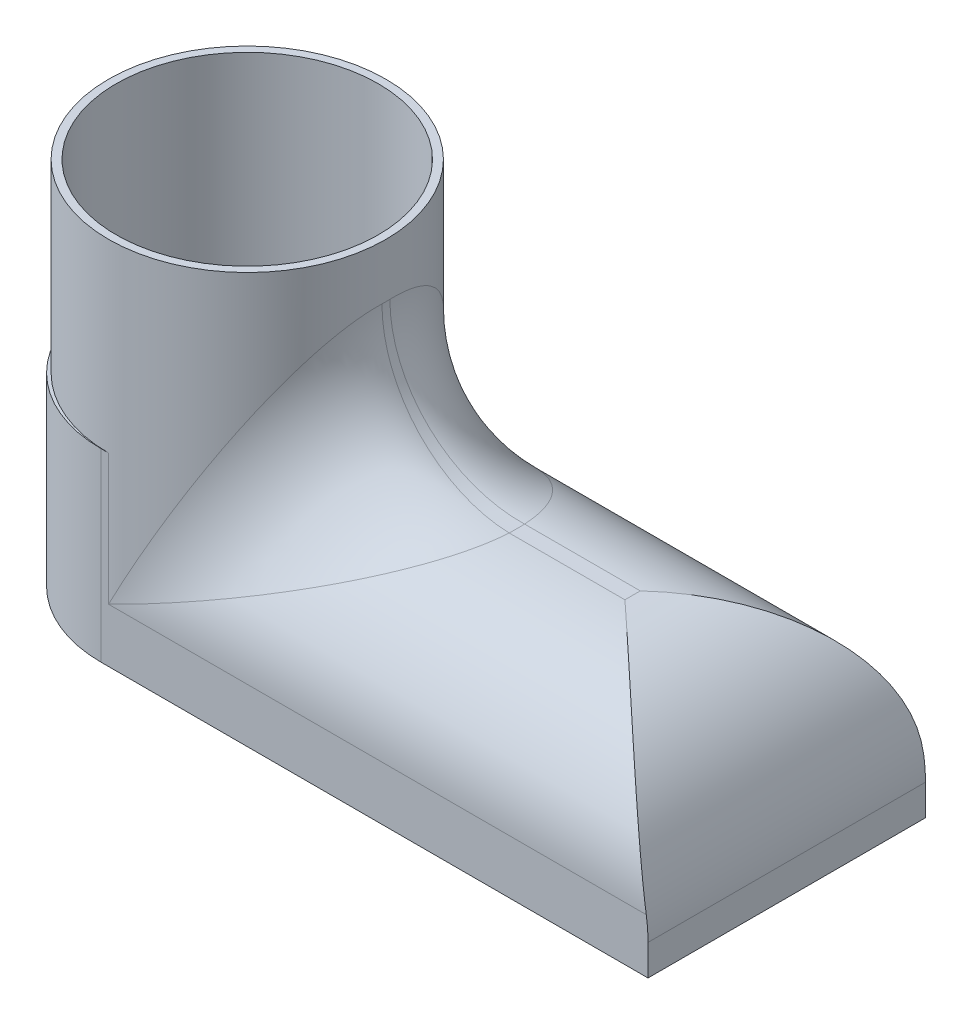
ISO-10303-21;
HEADER;
FILE_DESCRIPTION(('STEP AP214'),'2;1');
FILE_NAME('part.step','',(''),(''),'','','');
FILE_SCHEMA(('AUTOMOTIVE_DESIGN { 1 0 10303 214 1 1 1 1 }'));
ENDSEC;
DATA;
#1=APPLICATION_CONTEXT('core data for automotive mechanical design processes');
#2=APPLICATION_PROTOCOL_DEFINITION('international standard','automotive_design',2000,#1);
#3=PRODUCT_CONTEXT('',#1,'mechanical');
#4=PRODUCT('Part','Part','',(#3));
#5=PRODUCT_RELATED_PRODUCT_CATEGORY('part','',(#4));
#6=PRODUCT_DEFINITION_FORMATION('','',#4);
#7=PRODUCT_DEFINITION_CONTEXT('part definition',#1,'design');
#8=PRODUCT_DEFINITION('design','',#6,#7);
#9=PRODUCT_DEFINITION_SHAPE('','',#8);
#10=(LENGTH_UNIT() NAMED_UNIT(*) SI_UNIT(.MILLI.,.METRE.));
#11=(NAMED_UNIT(*) PLANE_ANGLE_UNIT() SI_UNIT($,.RADIAN.));
#12=(NAMED_UNIT(*) SI_UNIT($,.STERADIAN.) SOLID_ANGLE_UNIT());
#13=UNCERTAINTY_MEASURE_WITH_UNIT(LENGTH_MEASURE(1.E-05),#10,'distance_accuracy_value','');
#14=(GEOMETRIC_REPRESENTATION_CONTEXT(3) GLOBAL_UNCERTAINTY_ASSIGNED_CONTEXT((#13)) GLOBAL_UNIT_ASSIGNED_CONTEXT((#10,
#11,#12)) REPRESENTATION_CONTEXT('',''));
#15=CARTESIAN_POINT('',(0.,0.,0.));
#16=DIRECTION('',(0.,0.,1.));
#17=DIRECTION('',(1.,0.,0.));
#18=AXIS2_PLACEMENT_3D('',#15,#16,#17);
#19=CARTESIAN_POINT('',(0.,76.2,0.));
#20=DIRECTION('',(0.,1.,0.));
#21=DIRECTION('',(0.,0.,1.));
#22=AXIS2_PLACEMENT_3D('',#19,#20,#21);
#23=PLANE('',#22);
#24=CARTESIAN_POINT('',(0.,76.2,0.));
#25=DIRECTION('',(0.,1.,0.));
#26=DIRECTION('',(0.,0.,1.));
#27=AXIS2_PLACEMENT_3D('',#24,#25,#26);
#28=CIRCLE('',#27,57.15);
#29=CARTESIAN_POINT('',(0.,76.2,57.15));
#30=VERTEX_POINT('',#29);
#31=EDGE_CURVE('E180',#30,#30,#28,.T.);
#32=ORIENTED_EDGE('',*,*,#31,.T.);
#33=EDGE_LOOP('',(#32));
#34=FACE_BOUND('',#33,.T.);
#35=CARTESIAN_POINT('',(0.,76.2,0.));
#36=DIRECTION('',(0.,1.,0.));
#37=DIRECTION('',(0.,0.,1.));
#38=AXIS2_PLACEMENT_3D('',#35,#36,#37);
#39=CIRCLE('',#38,53.975);
#40=CARTESIAN_POINT('',(0.,76.2,-53.975));
#41=VERTEX_POINT('',#40);
#42=EDGE_CURVE('E174',#41,#41,#39,.T.);
#43=ORIENTED_EDGE('',*,*,#42,.F.);
#44=EDGE_LOOP('',(#43));
#45=FACE_BOUND('',#44,.T.);
#46=ADVANCED_FACE('F33',(#34,#45),#23,.T.);
#47=CARTESIAN_POINT('',(0.,76.2,0.));
#48=DIRECTION('',(0.,-1.,0.));
#49=DIRECTION('',(0.,0.,-1.));
#50=AXIS2_PLACEMENT_3D('',#47,#48,#49);
#51=CYLINDRICAL_SURFACE('',#50,57.15);
#52=ORIENTED_EDGE('',*,*,#31,.F.);
#53=EDGE_LOOP('',(#52));
#54=FACE_BOUND('',#53,.T.);
#55=DIRECTION('',(0.,-1.,0.));
#56=VECTOR('',#55,1.);
#57=CARTESIAN_POINT('',(0.,-26.9875,57.15));
#58=LINE('',#57,#56);
#59=CARTESIAN_POINT('',(0.,-53.975,57.15));
#60=VERTEX_POINT('',#59);
#61=CARTESIAN_POINT('',(0.,0.,57.15));
#62=VERTEX_POINT('',#61);
#63=EDGE_CURVE('E335',#60,#62,#58,.F.);
#64=ORIENTED_EDGE('',*,*,#63,.F.);
#65=CARTESIAN_POINT('',(108.214686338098,-1.90692331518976,-11.0452677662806));
#66=CARTESIAN_POINT('',(58.6237960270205,1.03572401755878,-0.27064737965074));
#67=CARTESIAN_POINT('',(55.6532672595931,50.1611533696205,-12.9937039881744));
#68=CARTESIAN_POINT('',(108.480611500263,-1.75139233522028,-10.4758374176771));
#69=CARTESIAN_POINT('',(58.5290166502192,0.963499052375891,-0.0700237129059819));
#70=CARTESIAN_POINT('',(55.7900287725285,50.4722153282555,-12.4080042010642));
#71=CARTESIAN_POINT('',(108.729587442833,-1.6047196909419,-9.90198398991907));
#72=CARTESIAN_POINT('',(58.4335246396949,0.889867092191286,0.109956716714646));
#73=CARTESIAN_POINT('',(55.9180735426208,50.7655606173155,-11.8177549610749));
#74=CARTESIAN_POINT('',(109.192480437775,-1.32963918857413,-8.74636835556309));
#75=CARTESIAN_POINT('',(58.2445967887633,0.743579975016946,0.432619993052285));
#76=CARTESIAN_POINT('',(56.1561327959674,51.3157216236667,-10.629121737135));
#77=CARTESIAN_POINT('',(109.406394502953,-1.20123288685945,-8.16460547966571));
#78=CARTESIAN_POINT('',(58.1512224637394,0.670969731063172,0.575048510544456));
#79=CARTESIAN_POINT('',(56.2661457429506,51.5725342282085,-10.0307370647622));
#80=CARTESIAN_POINT('',(109.798020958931,-0.963221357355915,-6.99401626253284));
#81=CARTESIAN_POINT('',(57.9706573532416,0.531026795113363,0.825262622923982));
#82=CARTESIAN_POINT('',(56.4675536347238,52.0485572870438,-8.82670244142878));
#83=CARTESIAN_POINT('',(109.975721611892,-0.853622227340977,-6.40518769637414));
#84=CARTESIAN_POINT('',(57.8835464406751,0.463757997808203,0.932830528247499));
#85=CARTESIAN_POINT('',(56.558942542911,52.2677555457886,-8.22105020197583));
#86=CARTESIAN_POINT('',(110.293819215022,-0.653757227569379,-5.22177065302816));
#87=CARTESIAN_POINT('',(57.719382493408,0.338538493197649,1.11740202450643));
#88=CARTESIAN_POINT('',(56.7225355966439,52.6674855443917,-7.00382124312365));
#89=CARTESIAN_POINT('',(110.434217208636,-0.563490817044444,-4.62718233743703));
#90=CARTESIAN_POINT('',(57.6424137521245,0.280657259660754,1.19425028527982));
#91=CARTESIAN_POINT('',(56.794740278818,52.8480183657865,-6.39224468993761));
#92=CARTESIAN_POINT('',(110.676408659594,-0.4029900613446,-3.43562937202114));
#93=CARTESIAN_POINT('',(57.5021902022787,0.177973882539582,1.32238868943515));
#94=CARTESIAN_POINT('',(56.9192958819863,53.1690198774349,-5.16664735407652));
#95=CARTESIAN_POINT('',(110.778344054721,-0.332682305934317,-2.83868183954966));
#96=CARTESIAN_POINT('',(57.4389654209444,0.133190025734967,1.37366727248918));
#97=CARTESIAN_POINT('',(56.9717197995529,53.309635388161,-4.55264417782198));
#98=CARTESIAN_POINT('',(110.94369443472,-0.21195391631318,-1.64138426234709));
#99=CARTESIAN_POINT('',(57.3285802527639,0.0592978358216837,1.4573190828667));
#100=CARTESIAN_POINT('',(57.056757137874,53.5510921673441,-3.32113809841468));
#101=CARTESIAN_POINT('',(111.007105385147,-0.161535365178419,-1.04103386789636));
#102=CARTESIAN_POINT('',(57.2814896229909,0.0302457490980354,1.48962638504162));
#103=CARTESIAN_POINT('',(57.0893684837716,53.651929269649,-2.70363483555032));
#104=CARTESIAN_POINT('',(111.094915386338,-0.080817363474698,0.161565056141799));
#105=CARTESIAN_POINT('',(57.2053175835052,-0.010082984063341,1.54233906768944));
#106=CARTESIAN_POINT('',(57.1345279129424,53.8133652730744,-1.46667594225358));
#107=CARTESIAN_POINT('',(111.119325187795,-0.0505123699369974,0.763813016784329));
#108=CARTESIAN_POINT('',(57.1762788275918,-0.0213300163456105,1.56271540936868));
#109=CARTESIAN_POINT('',(57.1470815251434,53.8739752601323,-0.847220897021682));
#110=CARTESIAN_POINT('',(111.128916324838,-0.0101024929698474,1.9691336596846));
#111=CARTESIAN_POINT('',(57.1371953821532,-0.0249069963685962,1.59912263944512));
#112=CARTESIAN_POINT('',(57.1520141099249,53.954795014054,0.392537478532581));
#113=CARTESIAN_POINT('',(111.114093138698,6.18294874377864E-08,2.57220642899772));
#114=CARTESIAN_POINT('',(57.1271748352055,-0.0172257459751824,1.61513802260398));
#115=CARTESIAN_POINT('',(57.1443907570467,53.9750001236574,1.01284089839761));
#116=CARTESIAN_POINT('',(111.044531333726,-6.29826983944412E-08,3.78903655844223));
#117=CARTESIAN_POINT('',(57.1261533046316,0.0175413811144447,1.65090093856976));
#118=CARTESIAN_POINT('',(57.1086161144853,53.9749998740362,2.26443760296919));
#119=CARTESIAN_POINT('',(110.989053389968,-0.0104831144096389,4.40278340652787));
#120=CARTESIAN_POINT('',(57.1355045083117,0.0449670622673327,1.67069798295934));
#121=CARTESIAN_POINT('',(57.0800846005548,53.9540337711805,2.8957200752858));
#122=CARTESIAN_POINT('',(110.837533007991,-0.0523002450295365,5.62838292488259));
#123=CARTESIAN_POINT('',(57.172931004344,0.1187211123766,1.72187703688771));
#124=CARTESIAN_POINT('',(57.0021598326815,53.8703995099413,4.15633672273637));
#125=CARTESIAN_POINT('',(110.741485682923,-0.0836368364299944,6.24023535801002));
#126=CARTESIAN_POINT('',(57.200974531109,0.165004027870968,1.75322896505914));
#127=CARTESIAN_POINT('',(56.9527640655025,53.8077263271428,4.78567065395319));
#128=CARTESIAN_POINT('',(110.509253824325,-0.166930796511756,7.46059913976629));
#129=CARTESIAN_POINT('',(57.2737576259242,0.274537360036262,1.83507321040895));
#130=CARTESIAN_POINT('',(56.8333305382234,53.641138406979,6.04090197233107));
#131=CARTESIAN_POINT('',(110.373070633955,-0.218887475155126,8.06911059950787));
#132=CARTESIAN_POINT('',(57.3184401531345,0.337716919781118,1.88550071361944));
#133=CARTESIAN_POINT('',(56.7632934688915,53.5372250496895,6.66679947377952));
#134=CARTESIAN_POINT('',(110.061185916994,-0.343090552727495,9.28158196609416));
#135=CARTESIAN_POINT('',(57.4215999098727,0.478215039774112,2.01224527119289));
#136=CARTESIAN_POINT('',(56.6028956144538,53.2888188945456,7.91391287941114));
#137=CARTESIAN_POINT('',(109.885479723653,-0.415339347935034,9.8855413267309));
#138=CARTESIAN_POINT('',(57.4800083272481,0.555450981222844,2.08845643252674));
#139=CARTESIAN_POINT('',(56.5125324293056,53.144321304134,8.5351282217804));
#140=CARTESIAN_POINT('',(109.495458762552,-0.579659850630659,11.0873962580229));
#141=CARTESIAN_POINT('',(57.6069786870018,0.72045674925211,2.27241663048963));
#142=CARTESIAN_POINT('',(56.3119502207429,52.8156802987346,9.77132186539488));
#143=CARTESIAN_POINT('',(109.281157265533,-0.671724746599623,11.6852938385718));
#144=CARTESIAN_POINT('',(57.6754630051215,0.808135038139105,2.37999414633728));
#145=CARTESIAN_POINT('',(56.2017380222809,52.6315505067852,10.3863022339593));
#146=CARTESIAN_POINT('',(108.81488699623,-0.875180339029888,12.8741513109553));
#147=CARTESIAN_POINT('',(57.8184903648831,0.989959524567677,2.63114698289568));
#148=CARTESIAN_POINT('',(55.9619418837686,52.2246393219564,11.6091270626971));
#149=CARTESIAN_POINT('',(108.562913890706,-0.986573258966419,13.4651103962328));
#150=CARTESIAN_POINT('',(57.8929671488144,1.08402602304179,2.77451285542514));
#151=CARTESIAN_POINT('',(55.832355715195,52.0018534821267,12.2169706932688));
#152=CARTESIAN_POINT('',(108.022498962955,-1.2280698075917,14.6388959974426));
#153=CARTESIAN_POINT('',(58.0435503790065,1.2741928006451,3.10036466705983));
#154=CARTESIAN_POINT('',(55.5544280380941,51.5188603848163,13.4242930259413));
#155=CARTESIAN_POINT('',(107.734062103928,-1.35817089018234,15.2217236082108));
#156=CARTESIAN_POINT('',(58.1196066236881,1.37022979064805,3.28258232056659));
#157=CARTESIAN_POINT('',(55.4060890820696,51.258658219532,14.0237728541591));
#158=CARTESIAN_POINT('',(107.121966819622,-1.63643839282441,16.3783944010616));
#159=CARTESIAN_POINT('',(58.2688732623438,1.55984478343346,3.68790471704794));
#160=CARTESIAN_POINT('',(55.09129722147,50.7021232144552,15.2134913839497));
#161=CARTESIAN_POINT('',(106.798304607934,-1.78460675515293,16.9522366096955));
#162=CARTESIAN_POINT('',(58.3420586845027,1.65338556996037,3.91071061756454));
#163=CARTESIAN_POINT('',(54.9248423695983,50.4057864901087,15.803729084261));
#164=CARTESIAN_POINT('',(105.781271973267,-2.25297725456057,18.6509655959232));
#165=CARTESIAN_POINT('',(58.5491781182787,1.9216565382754,4.63633189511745));
#166=CARTESIAN_POINT('',(54.4017970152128,49.4690454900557,17.5509931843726));
#167=CARTESIAN_POINT('',(105.037929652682,-2.59880195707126,19.7615172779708));
#168=CARTESIAN_POINT('',(58.6730146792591,2.0869140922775,5.20048827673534));
#169=CARTESIAN_POINT('',(54.0195066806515,48.7773960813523,18.6932749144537));
#170=CARTESIAN_POINT('',(103.429137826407,-3.35307896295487,21.9379693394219));
#171=CARTESIAN_POINT('',(58.8604585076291,2.35825524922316,6.48668817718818));
#172=CARTESIAN_POINT('',(53.192128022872,47.2688420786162,20.9319113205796));
#173=CARTESIAN_POINT('',(102.563690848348,-3.76152996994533,23.0038706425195));
#174=CARTESIAN_POINT('',(58.9246517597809,2.46485350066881,7.20595043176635));
#175=CARTESIAN_POINT('',(52.7470409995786,46.451940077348,22.0282669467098));
#176=CARTESIAN_POINT('',(100.721620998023,-4.63542564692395,25.088120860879));
#177=CARTESIAN_POINT('',(58.9682855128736,2.59393118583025,8.78235040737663));
#178=CARTESIAN_POINT('',(51.7996907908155,44.7041487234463,24.1720671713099));
#179=CARTESIAN_POINT('',(99.7449183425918,-5.10091123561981,26.1064349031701));
#180=CARTESIAN_POINT('',(58.9487339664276,2.61736862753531,9.63703391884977));
#181=CARTESIAN_POINT('',(51.2973865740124,43.773177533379,25.2194759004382));
#182=CARTESIAN_POINT('',(97.6920322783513,-6.08290276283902,28.092365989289));
#183=CARTESIAN_POINT('',(58.8080218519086,2.56280741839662,11.4567140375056));
#184=CARTESIAN_POINT('',(50.2416166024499,41.8091944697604,27.2621478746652));
#185=CARTESIAN_POINT('',(96.6158255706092,-6.59942065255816,29.0599710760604));
#186=CARTESIAN_POINT('',(58.6882467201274,2.48616406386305,12.4196674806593));
#187=CARTESIAN_POINT('',(49.6881388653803,40.7761586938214,28.2573988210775));
#188=CARTESIAN_POINT('',(94.6964582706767,-7.5231160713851,30.6726695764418));
#189=CARTESIAN_POINT('',(58.3876122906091,2.25937546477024,14.1413742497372));
#190=CARTESIAN_POINT('',(48.7010356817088,38.9287678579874,29.9161744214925));
#191=CARTESIAN_POINT('',(93.8749719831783,-7.91917180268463,31.3306761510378));
#192=CARTESIAN_POINT('',(58.2352312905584,2.13761288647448,14.8764313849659));
#193=CARTESIAN_POINT('',(48.2785570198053,38.1366563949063,30.5929811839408));
#194=CARTESIAN_POINT('',(92.1908861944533,-8.73238660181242,32.6196455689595));
#195=CARTESIAN_POINT('',(57.8731901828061,1.83657692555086,16.3763524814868));
#196=CARTESIAN_POINT('',(47.4124557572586,36.5102267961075,31.9187782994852));
#197=CARTESIAN_POINT('',(91.3282951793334,-9.14954131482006,33.2506139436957));
#198=CARTESIAN_POINT('',(57.6641163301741,1.65788936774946,17.1408525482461));
#199=CARTESIAN_POINT('',(46.9688375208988,35.6759173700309,32.5677743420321));
#200=CARTESIAN_POINT('',(88.6831067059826,-10.4304539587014,35.1034884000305));
#201=CARTESIAN_POINT('',(56.95367339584,1.03771961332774,19.4538250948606));
#202=CARTESIAN_POINT('',(45.6084548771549,33.1140920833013,34.4735880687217));
#203=CARTESIAN_POINT('',(86.843407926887,-11.3235091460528,36.2851020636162));
#204=CARTESIAN_POINT('',(56.3655245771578,0.509456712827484,21.0428469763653));
#205=CARTESIAN_POINT('',(44.6623240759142,31.3279817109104,35.6889621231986));
#206=CARTESIAN_POINT('',(83.0347189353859,-13.1759311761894,38.5426797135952));
#207=CARTESIAN_POINT('',(54.9658330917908,-0.772152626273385,24.2335439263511));
#208=CARTESIAN_POINT('',(42.7035697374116,27.6231376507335,38.0110419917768));
#209=CARTESIAN_POINT('',(81.065533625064,-14.1353982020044,39.6184778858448));
#210=CARTESIAN_POINT('',(54.1576742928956,-1.52205388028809,25.835891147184));
#211=CARTESIAN_POINT('',(41.6908458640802,25.704203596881,39.1175772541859));
#212=CARTESIAN_POINT('',(77.0213072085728,-16.1087066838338,41.6648015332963));
#213=CARTESIAN_POINT('',(52.3390618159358,-3.22615998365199,28.995901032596));
#214=CARTESIAN_POINT('',(39.6109579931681,21.7575866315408,41.2223672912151));
#215=CARTESIAN_POINT('',(74.9462649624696,-17.1225487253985,42.6353258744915));
#216=CARTESIAN_POINT('',(51.3313204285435,-4.17756914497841,30.5556799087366));
#217=CARTESIAN_POINT('',(38.5437934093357,19.7299025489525,42.2206208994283));
#218=CARTESIAN_POINT('',(69.8903242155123,-19.5954771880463,44.8287536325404));
#219=CARTESIAN_POINT('',(48.7219067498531,-6.65543033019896,34.1637710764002));
#220=CARTESIAN_POINT('',(35.943595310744,14.7840456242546,44.4767180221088));
#221=CARTESIAN_POINT('',(66.8685546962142,-21.0755554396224,46.0047450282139));
#222=CARTESIAN_POINT('',(47.033494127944,-8.2689350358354,36.1910097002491));
#223=CARTESIAN_POINT('',(34.3895424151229,11.8238891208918,45.6863091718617));
#224=CARTESIAN_POINT('',(62.2384805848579,-23.3457656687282,47.6274050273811));
#225=CARTESIAN_POINT('',(44.2797895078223,-10.9125739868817,39.0660225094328));
#226=CARTESIAN_POINT('',(32.0083614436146,7.28346866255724,47.355330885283));
#227=CARTESIAN_POINT('',(60.6783715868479,-24.1111038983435,48.1448799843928));
#228=CARTESIAN_POINT('',(43.3315034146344,-11.8247606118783,39.9918221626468));
#229=CARTESIAN_POINT('',(31.2060196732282,5.75279220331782,47.8875908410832));
#230=CARTESIAN_POINT('',(57.5293458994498,-25.6565909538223,49.1337836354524));
#231=CARTESIAN_POINT('',(41.3734966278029,-13.7114127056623,41.7792930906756));
#232=CARTESIAN_POINT('',(29.5865207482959,2.66181809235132,48.9047488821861));
#233=CARTESIAN_POINT('',(55.940429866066,-26.4367394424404,49.6052133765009));
#234=CARTESIAN_POINT('',(40.3636772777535,-14.6859459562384,42.6421180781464));
#235=CARTESIAN_POINT('',(28.7693639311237,1.10152111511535,49.3896480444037));
#236=CARTESIAN_POINT('',(51.1338107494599,-28.797635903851,50.9524754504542));
#237=CARTESIAN_POINT('',(37.2637466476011,-17.6815653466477,45.1181515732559));
#238=CARTESIAN_POINT('',(26.2973883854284,-3.62027180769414,50.7754033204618));
#239=CARTESIAN_POINT('',(47.8779640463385,-30.3979877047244,51.760680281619));
#240=CARTESIAN_POINT('',(35.0773652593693,-19.7994835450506,46.6445636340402));
#241=CARTESIAN_POINT('',(24.622952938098,-6.82097540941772,51.60669971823));
#242=CARTESIAN_POINT('',(41.2920009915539,-33.6369199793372,53.2030467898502));
#243=CARTESIAN_POINT('',(30.5422138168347,-24.2004192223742,49.3919224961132));
#244=CARTESIAN_POINT('',(21.2358862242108,-13.2988399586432,53.0902766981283));
#245=CARTESIAN_POINT('',(37.9619005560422,-35.2754922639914,53.8372453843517));
#246=CARTESIAN_POINT('',(28.1891839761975,-26.4874714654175,50.6207664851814));
#247=CARTESIAN_POINT('',(19.5232631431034,-16.5759845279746,53.7425952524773));
#248=CARTESIAN_POINT('',(31.7719582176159,-38.3223777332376,54.8514467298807));
#249=CARTESIAN_POINT('',(23.7402066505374,-30.8166413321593,52.596482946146));
#250=CARTESIAN_POINT('',(16.3398642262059,-22.6697554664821,54.7857737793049));
#251=CARTESIAN_POINT('',(28.9199306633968,-39.7266691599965,55.2556833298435));
#252=CARTESIAN_POINT('',(21.6606743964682,-32.8419987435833,53.391470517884));
#253=CARTESIAN_POINT('',(14.873107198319,-25.4783383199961,55.2015599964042));
#254=CARTESIAN_POINT('',(23.1877306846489,-42.549732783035,55.9469220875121));
#255=CARTESIAN_POINT('',(17.4426022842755,-36.9528319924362,54.7538476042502));
#256=CARTESIAN_POINT('',(11.925118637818,-31.1244655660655,55.9125484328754));
#257=CARTESIAN_POINT('',(20.3075575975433,-43.9685053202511,56.2339214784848));
#258=CARTESIAN_POINT('',(15.3000705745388,-39.0421818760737,55.3240679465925));
#259=CARTESIAN_POINT('',(10.4438867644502,-33.9620106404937,56.2077478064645));
#260=CARTESIAN_POINT('',(14.5347628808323,-46.8125825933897,56.6920184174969));
#261=CARTESIAN_POINT('',(10.9827388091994,-43.2540250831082,56.2345101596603));
#262=CARTESIAN_POINT('',(7.47502091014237,-39.6501651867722,56.6789332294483));
#263=CARTESIAN_POINT('',(11.6421760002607,-48.2378694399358,56.8633385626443));
#264=CARTESIAN_POINT('',(8.80371401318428,-45.380629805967,56.5770627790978));
#265=CARTESIAN_POINT('',(5.98740480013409,-42.5007388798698,56.8551482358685));
#266=CARTESIAN_POINT('',(5.84867708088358,-51.0927409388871,57.0919987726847));
#267=CARTESIAN_POINT('',(4.43053633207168,-49.6494140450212,57.0336713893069));
#268=CARTESIAN_POINT('',(3.00789107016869,-48.210481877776,57.0903415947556));
#269=CARTESIAN_POINT('',(2.94776800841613,-52.522324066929,57.149375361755));
#270=CARTESIAN_POINT('',(2.23189370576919,-51.7959741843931,57.1487492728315));
#271=CARTESIAN_POINT('',(1.51599497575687,-51.069648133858,57.1493575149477));
#272=CARTESIAN_POINT('',(0.0316558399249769,-53.9593998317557,57.1499983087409));
#273=CARTESIAN_POINT('',(0.0239679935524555,-53.9515997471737,57.1499966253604));
#274=CARTESIAN_POINT('',(0.016280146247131,-53.9437996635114,57.1499982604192));
#275=CARTESIAN_POINT('',(0.0158279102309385,-53.9671999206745,57.1499999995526));
#276=CARTESIAN_POINT('',(0.0119839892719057,-53.9632998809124,57.1500000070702));
#277=CARTESIAN_POINT('',(0.00814006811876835,-53.959399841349,57.1499999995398));
#278=CARTESIAN_POINT('',(0.,-53.975,57.15));
#279=CARTESIAN_POINT('',(0.,-53.975,57.15));
#280=CARTESIAN_POINT('',(0.,-53.975,57.15));
#281=(BOUNDED_SURFACE() B_SPLINE_SURFACE(3,2,((#65,#66,#67),(#68,#69,#70),(#71,#72,#73),(#74,
#75,#76),(#77,#78,#79),(#80,#81,#82),(#83,#84,#85),(#86,#87,#88),(#89,#90,#91),(#92,#93,#94),
(#95,#96,#97),(#98,#99,#100),(#101,#102,#103),(#104,#105,#106),(#107,#108,#109),(#110,#111,
#112),(#113,#114,#115),(#116,#117,#118),(#119,#120,#121),(#122,#123,#124),(#125,#126,#127),
(#128,#129,#130),(#131,#132,#133),(#134,#135,#136),(#137,#138,#139),(#140,#141,#142),(#143,#144,
#145),(#146,#147,#148),(#149,#150,#151),(#152,#153,#154),(#155,#156,#157),(#158,#159,#160),
(#161,#162,#163),(#164,#165,#166),(#167,#168,#169),(#170,#171,#172),(#173,#174,#175),(#176,#177,
#178),(#179,#180,#181),(#182,#183,#184),(#185,#186,#187),(#188,#189,#190),(#191,#192,#193),
(#194,#195,#196),(#197,#198,#199),(#200,#201,#202),(#203,#204,#205),(#206,#207,#208),(#209,#210,
#211),(#212,#213,#214),(#215,#216,#217),(#218,#219,#220),(#221,#222,#223),(#224,#225,#226),
(#227,#228,#229),(#230,#231,#232),(#233,#234,#235),(#236,#237,#238),(#239,#240,#241),(#242,#243,
#244),(#245,#246,#247),(#248,#249,#250),(#251,#252,#253),(#254,#255,#256),(#257,#258,#259),
(#260,#261,#262),(#263,#264,#265),(#266,#267,#268),(#269,#270,#271),(#272,#273,#274),(#275,#276,
#277),(#278,#279,#280)),.UNSPECIFIED.,.F.,.F.,.F.) B_SPLINE_SURFACE_WITH_KNOTS((4,2,2,2,2,2,2,2,
2,2,2,2,2,2,2,2,2,2,2,2,2,2,2,2,2,2,2,2,2,2,2,2,2,2,2,4),(3,3),(0.,3.63025956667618,
7.26082826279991,10.8925718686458,14.5242138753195,18.1423198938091,21.7608047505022,
25.3782919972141,28.996196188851,32.6815796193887,36.3674071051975,40.0531112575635,
43.7392508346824,47.4241253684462,51.10942408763,54.7942217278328,58.4794158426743,
65.7968012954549,73.1140352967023,80.4365500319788,87.760783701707,92.9846298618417,
98.207402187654,108.654983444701,119.118683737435,129.582496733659,144.079567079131,
151.332741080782,158.585750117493,173.099847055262,187.610862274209,199.854761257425,
212.098949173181,224.319508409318,236.536149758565,236.60282059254),(0.,1.),
.UNSPECIFIED.) GEOMETRIC_REPRESENTATION_ITEM() RATIONAL_B_SPLINE_SURFACE(((1.,0.727976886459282,
1.),(1.,0.726225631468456,1.),(1.,0.724566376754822,1.),(1.,0.721447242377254,1.),(1.,
0.719987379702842,1.),(1.,0.71728226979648,1.),(1.,0.716037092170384,1.),(1.,0.71377549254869,
1.),(1.,0.712759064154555,1.),(1.,0.710969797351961,1.),(1.,0.710196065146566,1.),(1.,
0.708895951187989,1.),(1.,0.70836959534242,1.),(1.,0.707570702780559,1.),(1.,0.707298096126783,
1.),(1.,0.707009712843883,1.),(1.,0.706993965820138,1.),(1.,0.707221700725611,1.),(1.,
0.707470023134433,1.),(1.,0.708230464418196,1.),(1.,0.708742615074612,1.),(1.,0.710024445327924,
1.),(1.,0.710794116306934,1.),(1.,0.712581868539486,1.),(1.,0.713599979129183,1.),(1.,
0.71587230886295,1.),(1.,0.717126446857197,1.),(1.,0.719857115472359,1.),(1.,0.721333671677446,
1.),(1.,0.724493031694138,1.),(1.,0.726175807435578,1.),(1.,0.729730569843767,1.),(1.,
0.731602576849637,1.),(1.,0.737448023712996,1.),(1.,0.741674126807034,1.),(1.,0.750655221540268,
1.),(1.,0.755410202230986,1.),(1.,0.765311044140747,1.),(1.,0.770457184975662,1.),(1.,
0.781007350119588,1.),(1.,0.786411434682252,1.),(1.,0.795789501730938,1.),(1.,0.799729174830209,
1.),(1.,0.807642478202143,1.),(1.,0.811616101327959,1.),(1.,0.823541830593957,1.),(1.,
0.83149724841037,1.),(1.,0.847206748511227,1.),(1.,0.854960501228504,1.),(1.,0.870094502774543,
1.),(1.,0.877474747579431,1.),(1.,0.894494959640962,1.),(1.,0.903909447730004,1.),(1.,
0.917160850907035,1.),(1.,0.921434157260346,1.),(1.,0.929674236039,1.),(1.,0.933641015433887,
1.),(1.,0.94506343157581,1.),(1.,0.952036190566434,1.),(1.,0.964608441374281,1.),(1.,
0.970208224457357,1.),(1.,0.97922674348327,1.),(1.,0.982849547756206,1.),(1.,0.989070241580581,
1.),(1.,0.991668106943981,1.),(1.,0.995824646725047,1.),(1.,0.997385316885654,1.),(1.,
0.999469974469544,1.),(1.,0.999994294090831,1.),(1.,0.999999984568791,1.),(1.,1.00000000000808,
1.),(1.,1.,1.))) REPRESENTATION_ITEM('') SURFACE());
#282=CARTESIAN_POINT('',(55.6532672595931,50.1611533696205,-12.9937039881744));
#283=CARTESIAN_POINT('',(55.7900287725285,50.4722153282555,-12.4080042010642));
#284=CARTESIAN_POINT('',(55.9180735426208,50.7655606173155,-11.8177549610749));
#285=CARTESIAN_POINT('',(56.1561327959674,51.3157216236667,-10.629121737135));
#286=CARTESIAN_POINT('',(56.2661457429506,51.5725342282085,-10.0307370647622));
#287=CARTESIAN_POINT('',(56.4675536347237,52.0485572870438,-8.82670244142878));
#288=CARTESIAN_POINT('',(56.558942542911,52.2677555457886,-8.22105020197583));
#289=CARTESIAN_POINT('',(56.7225355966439,52.6674855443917,-7.00382124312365));
#290=CARTESIAN_POINT('',(56.794740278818,52.8480183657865,-6.39224468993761));
#291=CARTESIAN_POINT('',(56.9192958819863,53.1690198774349,-5.16664735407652));
#292=CARTESIAN_POINT('',(56.9717197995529,53.309635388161,-4.55264417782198));
#293=CARTESIAN_POINT('',(57.056757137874,53.5510921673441,-3.32113809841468));
#294=CARTESIAN_POINT('',(57.0893684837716,53.651929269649,-2.70363483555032));
#295=CARTESIAN_POINT('',(57.1345279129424,53.8133652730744,-1.46667594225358));
#296=CARTESIAN_POINT('',(57.1470815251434,53.8739752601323,-0.847220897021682));
#297=CARTESIAN_POINT('',(57.1520141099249,53.954795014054,0.392537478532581));
#298=CARTESIAN_POINT('',(57.1443907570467,53.9750001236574,1.01284089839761));
#299=CARTESIAN_POINT('',(57.1086161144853,53.9749998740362,2.26443760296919));
#300=CARTESIAN_POINT('',(57.0800846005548,53.9540337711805,2.8957200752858));
#301=CARTESIAN_POINT('',(57.0021598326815,53.8703995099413,4.15633672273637));
#302=CARTESIAN_POINT('',(56.9527640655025,53.8077263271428,4.78567065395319));
#303=CARTESIAN_POINT('',(56.8333305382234,53.641138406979,6.04090197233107));
#304=CARTESIAN_POINT('',(56.7632934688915,53.5372250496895,6.66679947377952));
#305=CARTESIAN_POINT('',(56.6028956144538,53.2888188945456,7.91391287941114));
#306=CARTESIAN_POINT('',(56.5125324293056,53.144321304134,8.5351282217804));
#307=CARTESIAN_POINT('',(56.3119502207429,52.8156802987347,9.77132186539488));
#308=CARTESIAN_POINT('',(56.2017380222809,52.6315505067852,10.3863022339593));
#309=CARTESIAN_POINT('',(55.9619418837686,52.2246393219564,11.6091270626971));
#310=CARTESIAN_POINT('',(55.832355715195,52.0018534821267,12.2169706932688));
#311=CARTESIAN_POINT('',(55.5544280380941,51.5188603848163,13.4242930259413));
#312=CARTESIAN_POINT('',(55.4060890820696,51.258658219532,14.0237728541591));
#313=CARTESIAN_POINT('',(55.09129722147,50.7021232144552,15.2134913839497));
#314=CARTESIAN_POINT('',(54.9248423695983,50.4057864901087,15.803729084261));
#315=CARTESIAN_POINT('',(54.4017970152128,49.4690454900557,17.5509931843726));
#316=CARTESIAN_POINT('',(54.0195066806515,48.7773960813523,18.6932749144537));
#317=CARTESIAN_POINT('',(53.192128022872,47.2688420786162,20.9319113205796));
#318=CARTESIAN_POINT('',(52.7470409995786,46.451940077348,22.0282669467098));
#319=CARTESIAN_POINT('',(51.7996907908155,44.7041487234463,24.1720671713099));
#320=CARTESIAN_POINT('',(51.2973865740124,43.773177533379,25.2194759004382));
#321=CARTESIAN_POINT('',(50.2416166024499,41.8091944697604,27.2621478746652));
#322=CARTESIAN_POINT('',(49.6881388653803,40.7761586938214,28.2573988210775));
#323=CARTESIAN_POINT('',(48.7010356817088,38.9287678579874,29.9161744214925));
#324=CARTESIAN_POINT('',(48.2785570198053,38.1366563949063,30.5929811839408));
#325=CARTESIAN_POINT('',(47.4124557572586,36.5102267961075,31.9187782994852));
#326=CARTESIAN_POINT('',(46.9688375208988,35.6759173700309,32.5677743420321));
#327=CARTESIAN_POINT('',(45.6084548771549,33.1140920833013,34.4735880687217));
#328=CARTESIAN_POINT('',(44.6623240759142,31.3279817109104,35.6889621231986));
#329=CARTESIAN_POINT('',(42.7035697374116,27.6231376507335,38.0110419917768));
#330=CARTESIAN_POINT('',(41.6908458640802,25.704203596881,39.1175772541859));
#331=CARTESIAN_POINT('',(39.6109579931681,21.7575866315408,41.2223672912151));
#332=CARTESIAN_POINT('',(38.5437934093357,19.7299025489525,42.2206208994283));
#333=CARTESIAN_POINT('',(35.943595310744,14.7840456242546,44.4767180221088));
#334=CARTESIAN_POINT('',(34.3895424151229,11.8238891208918,45.6863091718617));
#335=CARTESIAN_POINT('',(32.0083614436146,7.28346866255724,47.355330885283));
#336=CARTESIAN_POINT('',(31.2060196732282,5.75279220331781,47.8875908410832));
#337=CARTESIAN_POINT('',(29.5865207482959,2.66181809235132,48.9047488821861));
#338=CARTESIAN_POINT('',(28.7693639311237,1.10152111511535,49.3896480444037));
#339=CARTESIAN_POINT('',(26.2973883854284,-3.62027180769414,50.7754033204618));
#340=CARTESIAN_POINT('',(24.622952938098,-6.82097540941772,51.60669971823));
#341=CARTESIAN_POINT('',(21.2358862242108,-13.2988399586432,53.0902766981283));
#342=CARTESIAN_POINT('',(19.5232631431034,-16.5759845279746,53.7425952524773));
#343=CARTESIAN_POINT('',(16.3398642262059,-22.6697554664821,54.7857737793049));
#344=CARTESIAN_POINT('',(14.873107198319,-25.4783383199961,55.2015599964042));
#345=CARTESIAN_POINT('',(11.925118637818,-31.1244655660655,55.9125484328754));
#346=CARTESIAN_POINT('',(10.4438867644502,-33.9620106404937,56.2077478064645));
#347=CARTESIAN_POINT('',(7.47502091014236,-39.6501651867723,56.6789332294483));
#348=CARTESIAN_POINT('',(5.98740480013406,-42.5007388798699,56.8551482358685));
#349=CARTESIAN_POINT('',(3.00789107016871,-48.210481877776,57.0903415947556));
#350=CARTESIAN_POINT('',(1.51599497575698,-51.0696481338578,57.1493575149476));
#351=CARTESIAN_POINT('',(0.016280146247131,-53.9437996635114,57.1499982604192));
#352=CARTESIAN_POINT('',(0.00814006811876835,-53.959399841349,57.1499999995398));
#353=CARTESIAN_POINT('',(0.,-53.975,57.15));
#354=B_SPLINE_CURVE_WITH_KNOTS('',3,(#282,#283,#284,#285,#286,#287,#288,#289,#290,#291,#292,
#293,#294,#295,#296,#297,#298,#299,#300,#301,#302,#303,#304,#305,#306,#307,#308,#309,#310,#311,
#312,#313,#314,#315,#316,#317,#318,#319,#320,#321,#322,#323,#324,#325,#326,#327,#328,#329,#330,
#331,#332,#333,#334,#335,#336,#337,#338,#339,#340,#341,#342,#343,#344,#345,#346,#347,#348,#349,
#350,#351,#352,#353),.UNSPECIFIED.,.F.,.F.,(4,2,2,2,2,2,2,2,2,2,2,2,2,2,2,2,2,2,2,2,2,2,2,2,2,2,
2,2,2,2,2,2,2,2,2,4),(0.,3.63025956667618,7.26082826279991,10.8925718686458,14.5242138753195,
18.1423198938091,21.7608047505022,25.3782919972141,28.996196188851,32.6815796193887,
36.3674071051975,40.0531112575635,43.7392508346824,47.4241253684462,51.10942408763,
54.7942217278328,58.4794158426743,65.7968012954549,73.1140352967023,80.4365500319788,
87.760783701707,92.9846298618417,98.207402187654,108.654983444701,119.118683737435,
129.582496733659,144.079567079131,151.332741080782,158.585750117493,173.099847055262,
187.610862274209,199.854761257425,212.098949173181,224.319508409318,236.536149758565,
236.60282059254),.UNSPECIFIED.);
#355=CARTESIAN_POINT('',(57.1266687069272,53.975,1.63285714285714));
#356=VERTEX_POINT('',#355);
#357=EDGE_CURVE('E312',#60,#356,#354,.F.);
#358=ORIENTED_EDGE('',*,*,#357,.T.);
#359=CARTESIAN_POINT('',(0.,53.975,0.));
#360=DIRECTION('',(0.,-1.,0.));
#361=DIRECTION('',(0.,0.,-1.));
#362=AXIS2_PLACEMENT_3D('',#359,#360,#361);
#363=CIRCLE('',#362,57.15);
#364=CARTESIAN_POINT('',(57.1266687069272,53.975,-1.63285714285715));
#365=VERTEX_POINT('',#364);
#366=EDGE_CURVE('E317',#356,#365,#363,.F.);
#367=ORIENTED_EDGE('',*,*,#366,.T.);
#368=CARTESIAN_POINT('',(55.6532672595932,50.1611533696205,12.9937039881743));
#369=CARTESIAN_POINT('',(58.6237960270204,1.03572401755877,0.270647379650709));
#370=CARTESIAN_POINT('',(108.214686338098,-1.90692331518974,11.0452677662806));
#371=CARTESIAN_POINT('',(55.7900287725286,50.4722153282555,12.4080042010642));
#372=CARTESIAN_POINT('',(58.5290166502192,0.963499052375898,0.0700237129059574));
#373=CARTESIAN_POINT('',(108.480611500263,-1.75139233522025,10.475837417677));
#374=CARTESIAN_POINT('',(55.9180735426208,50.7655606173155,11.8177549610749));
#375=CARTESIAN_POINT('',(58.4335246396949,0.889867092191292,-0.109956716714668));
#376=CARTESIAN_POINT('',(108.729587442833,-1.60471969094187,9.901983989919));
#377=CARTESIAN_POINT('',(56.1561327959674,51.3157216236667,10.629121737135));
#378=CARTESIAN_POINT('',(58.2445967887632,0.74357997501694,-0.432619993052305));
#379=CARTESIAN_POINT('',(109.192480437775,-1.32963918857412,8.74636835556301));
#380=CARTESIAN_POINT('',(56.2661457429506,51.5725342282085,10.0307370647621));
#381=CARTESIAN_POINT('',(58.1512224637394,0.670969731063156,-0.575048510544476));
#382=CARTESIAN_POINT('',(109.406394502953,-1.20123288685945,8.16460547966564));
#383=CARTESIAN_POINT('',(56.4675536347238,52.0485572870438,8.8267024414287));
#384=CARTESIAN_POINT('',(57.9706573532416,0.531026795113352,-0.825262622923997));
#385=CARTESIAN_POINT('',(109.798020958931,-0.963221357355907,6.99401626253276));
#386=CARTESIAN_POINT('',(56.558942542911,52.2677555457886,8.22105020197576));
#387=CARTESIAN_POINT('',(57.8835464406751,0.463757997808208,-0.932830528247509));
#388=CARTESIAN_POINT('',(109.975721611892,-0.853622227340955,6.40518769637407));
#389=CARTESIAN_POINT('',(56.722535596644,52.6674855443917,7.00382124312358));
#390=CARTESIAN_POINT('',(57.719382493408,0.338538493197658,-1.11740202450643));
#391=CARTESIAN_POINT('',(110.293819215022,-0.653757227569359,5.22177065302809));
#392=CARTESIAN_POINT('',(56.794740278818,52.8480183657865,6.39224468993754));
#393=CARTESIAN_POINT('',(57.6424137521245,0.280657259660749,-1.19425028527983));
#394=CARTESIAN_POINT('',(110.434217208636,-0.563490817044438,4.62718233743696));
#395=CARTESIAN_POINT('',(56.9192958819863,53.169019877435,5.16664735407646));
#396=CARTESIAN_POINT('',(57.5021902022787,0.177973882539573,-1.32238868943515));
#397=CARTESIAN_POINT('',(110.676408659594,-0.402990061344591,3.43562937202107));
#398=CARTESIAN_POINT('',(56.9717197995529,53.309635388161,4.55264417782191));
#399=CARTESIAN_POINT('',(57.4389654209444,0.133190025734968,-1.37366727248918));
#400=CARTESIAN_POINT('',(110.778344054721,-0.33268230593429,2.8386818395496));
#401=CARTESIAN_POINT('',(57.056757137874,53.5510921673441,3.32113809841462));
#402=CARTESIAN_POINT('',(57.3285802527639,0.0592978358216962,-1.4573190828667));
#403=CARTESIAN_POINT('',(110.94369443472,-0.211953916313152,1.64138426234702));
#404=CARTESIAN_POINT('',(57.0893684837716,53.651929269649,2.70363483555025));
#405=CARTESIAN_POINT('',(57.2814896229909,0.0302457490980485,-1.48962638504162));
#406=CARTESIAN_POINT('',(111.007105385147,-0.161535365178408,1.0410338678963));
#407=CARTESIAN_POINT('',(57.1345279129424,53.8133652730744,1.46667594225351));
#408=CARTESIAN_POINT('',(57.2053175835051,-0.0100829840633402,-1.54233906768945));
#409=CARTESIAN_POINT('',(111.094915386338,-0.0808173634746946,-0.16156505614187));
#410=CARTESIAN_POINT('',(57.1470815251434,53.8739752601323,0.847220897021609));
#411=CARTESIAN_POINT('',(57.1762788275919,-0.0213300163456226,-1.56271540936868));
#412=CARTESIAN_POINT('',(111.119325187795,-0.0505123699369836,-0.763813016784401));
#413=CARTESIAN_POINT('',(57.1520141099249,53.954795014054,-0.392537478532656));
#414=CARTESIAN_POINT('',(57.1371953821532,-0.0249069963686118,-1.59912263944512));
#415=CARTESIAN_POINT('',(111.128916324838,-0.0101024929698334,-1.96913365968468));
#416=CARTESIAN_POINT('',(57.1443907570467,53.9750001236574,-1.01284089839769));
#417=CARTESIAN_POINT('',(57.1271748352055,-0.0172257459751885,-1.61513802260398));
#418=CARTESIAN_POINT('',(111.114093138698,6.18294910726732E-08,-2.57220642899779));
#419=CARTESIAN_POINT('',(57.1086161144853,53.9749998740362,-2.26443760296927));
#420=CARTESIAN_POINT('',(57.1261533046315,0.0175413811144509,-1.65090093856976));
#421=CARTESIAN_POINT('',(111.044531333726,-6.29827020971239E-08,-3.78903655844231));
#422=CARTESIAN_POINT('',(57.0800846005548,53.9540337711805,-2.89572007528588));
#423=CARTESIAN_POINT('',(57.1355045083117,0.0449670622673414,-1.67069798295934));
#424=CARTESIAN_POINT('',(110.989053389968,-0.0104831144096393,-4.40278340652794));
#425=CARTESIAN_POINT('',(57.0021598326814,53.8703995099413,-4.15633672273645));
#426=CARTESIAN_POINT('',(57.172931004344,0.118721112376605,-1.72187703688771));
#427=CARTESIAN_POINT('',(110.837533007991,-0.0523002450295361,-5.62838292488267));
#428=CARTESIAN_POINT('',(56.9527640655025,53.8077263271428,-4.78567065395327));
#429=CARTESIAN_POINT('',(57.200974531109,0.165004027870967,-1.75322896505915));
#430=CARTESIAN_POINT('',(110.741485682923,-0.0836368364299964,-6.2402353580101));
#431=CARTESIAN_POINT('',(56.8333305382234,53.641138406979,-6.04090197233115));
#432=CARTESIAN_POINT('',(57.2737576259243,0.274537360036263,-1.83507321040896));
#433=CARTESIAN_POINT('',(110.509253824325,-0.166930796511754,-7.46059913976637));
#434=CARTESIAN_POINT('',(56.7632934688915,53.5372250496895,-6.6667994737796));
#435=CARTESIAN_POINT('',(57.3184401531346,0.337716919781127,-1.88550071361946));
#436=CARTESIAN_POINT('',(110.373070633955,-0.218887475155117,-8.06911059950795));
#437=CARTESIAN_POINT('',(56.6028956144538,53.2888188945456,-7.91391287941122));
#438=CARTESIAN_POINT('',(57.4215999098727,0.478215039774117,-2.01224527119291));
#439=CARTESIAN_POINT('',(110.061185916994,-0.34309055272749,-9.28158196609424));
#440=CARTESIAN_POINT('',(56.5125324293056,53.144321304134,-8.53512822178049));
#441=CARTESIAN_POINT('',(57.4800083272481,0.555450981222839,-2.08845643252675));
#442=CARTESIAN_POINT('',(109.885479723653,-0.415339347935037,-9.88554132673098));
#443=CARTESIAN_POINT('',(56.3119502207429,52.8156802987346,-9.77132186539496));
#444=CARTESIAN_POINT('',(57.6069786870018,0.720456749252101,-2.27241663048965));
#445=CARTESIAN_POINT('',(109.495458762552,-0.579659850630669,-11.0873962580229));
#446=CARTESIAN_POINT('',(56.2017380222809,52.6315505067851,-10.3863022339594));
#447=CARTESIAN_POINT('',(57.6754630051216,0.808135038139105,-2.3799941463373));
#448=CARTESIAN_POINT('',(109.281157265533,-0.671724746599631,-11.6852938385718));
#449=CARTESIAN_POINT('',(55.9619418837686,52.2246393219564,-11.6091270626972));
#450=CARTESIAN_POINT('',(57.8184903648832,0.989959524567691,-2.6311469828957));
#451=CARTESIAN_POINT('',(108.81488699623,-0.875180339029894,-12.8741513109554));
#452=CARTESIAN_POINT('',(55.832355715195,52.0018534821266,-12.2169706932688));
#453=CARTESIAN_POINT('',(57.8929671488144,1.08402602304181,-2.77451285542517));
#454=CARTESIAN_POINT('',(108.562913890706,-0.986573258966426,-13.4651103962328));
#455=CARTESIAN_POINT('',(55.5544280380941,51.5188603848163,-13.4242930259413));
#456=CARTESIAN_POINT('',(58.0435503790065,1.27419280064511,-3.10036466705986));
#457=CARTESIAN_POINT('',(108.022498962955,-1.22806980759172,-14.6388959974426));
#458=CARTESIAN_POINT('',(55.4060890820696,51.2586582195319,-14.0237728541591));
#459=CARTESIAN_POINT('',(58.1196066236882,1.37022979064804,-3.28258232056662));
#460=CARTESIAN_POINT('',(107.734062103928,-1.35817089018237,-15.2217236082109));
#461=CARTESIAN_POINT('',(55.0912972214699,50.7021232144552,-15.2134913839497));
#462=CARTESIAN_POINT('',(58.2688732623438,1.55984478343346,-3.68790471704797));
#463=CARTESIAN_POINT('',(107.121966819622,-1.63643839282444,-16.3783944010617));
#464=CARTESIAN_POINT('',(54.9248423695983,50.4057864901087,-15.8037290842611));
#465=CARTESIAN_POINT('',(58.3420586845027,1.65338556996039,-3.91071061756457));
#466=CARTESIAN_POINT('',(106.798304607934,-1.78460675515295,-16.9522366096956));
#467=CARTESIAN_POINT('',(54.4017970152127,49.4690454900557,-17.5509931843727));
#468=CARTESIAN_POINT('',(58.5491781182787,1.92165653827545,-4.63633189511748));
#469=CARTESIAN_POINT('',(105.781271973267,-2.25297725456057,-18.6509655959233));
#470=CARTESIAN_POINT('',(54.0195066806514,48.7773960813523,-18.6932749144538));
#471=CARTESIAN_POINT('',(58.673014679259,2.08691409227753,-5.20048827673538));
#472=CARTESIAN_POINT('',(105.037929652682,-2.59880195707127,-19.7615172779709));
#473=CARTESIAN_POINT('',(53.192128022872,47.2688420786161,-20.9319113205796));
#474=CARTESIAN_POINT('',(58.8604585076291,2.35825524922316,-6.48668817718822));
#475=CARTESIAN_POINT('',(103.429137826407,-3.3530789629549,-21.9379693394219));
#476=CARTESIAN_POINT('',(52.7470409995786,46.451940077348,-22.0282669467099));
#477=CARTESIAN_POINT('',(58.9246517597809,2.46485350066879,-7.20595043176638));
#478=CARTESIAN_POINT('',(102.563690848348,-3.76152996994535,-23.0038706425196));
#479=CARTESIAN_POINT('',(51.7996907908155,44.7041487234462,-24.17206717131));
#480=CARTESIAN_POINT('',(58.9682855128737,2.59393118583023,-8.78235040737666));
#481=CARTESIAN_POINT('',(100.721620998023,-4.63542564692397,-25.0881208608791));
#482=CARTESIAN_POINT('',(51.2973865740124,43.7731775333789,-25.2194759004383));
#483=CARTESIAN_POINT('',(58.9487339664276,2.61736862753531,-9.63703391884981));
#484=CARTESIAN_POINT('',(99.7449183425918,-5.10091123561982,-26.1064349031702));
#485=CARTESIAN_POINT('',(50.2416166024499,41.8091944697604,-27.2621478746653));
#486=CARTESIAN_POINT('',(58.8080218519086,2.56280741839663,-11.4567140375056));
#487=CARTESIAN_POINT('',(97.6920322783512,-6.08290276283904,-28.092365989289));
#488=CARTESIAN_POINT('',(49.6881388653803,40.7761586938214,-28.2573988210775));
#489=CARTESIAN_POINT('',(58.6882467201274,2.48616406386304,-12.4196674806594));
#490=CARTESIAN_POINT('',(96.6158255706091,-6.5994206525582,-29.0599710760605));
#491=CARTESIAN_POINT('',(48.7010356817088,38.9287678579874,-29.9161744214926));
#492=CARTESIAN_POINT('',(58.3876122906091,2.25937546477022,-14.1413742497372));
#493=CARTESIAN_POINT('',(94.6964582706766,-7.52311607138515,-30.6726695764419));
#494=CARTESIAN_POINT('',(48.2785570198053,38.1366563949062,-30.5929811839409));
#495=CARTESIAN_POINT('',(58.2352312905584,2.13761288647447,-14.876431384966));
#496=CARTESIAN_POINT('',(93.8749719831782,-7.91917180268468,-31.3306761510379));
#497=CARTESIAN_POINT('',(47.4124557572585,36.5102267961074,-31.9187782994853));
#498=CARTESIAN_POINT('',(57.8731901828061,1.83657692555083,-16.3763524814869));
#499=CARTESIAN_POINT('',(92.1908861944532,-8.73238660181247,-32.6196455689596));
#500=CARTESIAN_POINT('',(46.9688375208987,35.6759173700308,-32.5677743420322));
#501=CARTESIAN_POINT('',(57.664116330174,1.65788936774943,-17.1408525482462));
#502=CARTESIAN_POINT('',(91.3282951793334,-9.14954131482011,-33.2506139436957));
#503=CARTESIAN_POINT('',(45.6084548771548,33.1140920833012,-34.4735880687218));
#504=CARTESIAN_POINT('',(56.95367339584,1.0377196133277,-19.4538250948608));
#505=CARTESIAN_POINT('',(88.6831067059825,-10.4304539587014,-35.1034884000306));
#506=CARTESIAN_POINT('',(44.6623240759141,31.3279817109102,-35.6889621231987));
#507=CARTESIAN_POINT('',(56.3655245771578,0.509456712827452,-21.0428469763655));
#508=CARTESIAN_POINT('',(86.8434079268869,-11.3235091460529,-36.2851020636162));
#509=CARTESIAN_POINT('',(42.7035697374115,27.6231376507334,-38.0110419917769));
#510=CARTESIAN_POINT('',(54.9658330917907,-0.772152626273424,-24.2335439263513));
#511=CARTESIAN_POINT('',(83.0347189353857,-13.1759311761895,-38.5426797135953));
#512=CARTESIAN_POINT('',(41.6908458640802,25.7042035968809,-39.117577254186));
#513=CARTESIAN_POINT('',(54.1576742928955,-1.52205388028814,-25.8358911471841));
#514=CARTESIAN_POINT('',(81.0655336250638,-14.1353982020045,-39.6184778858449));
#515=CARTESIAN_POINT('',(39.6109579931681,21.7575866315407,-41.2223672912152));
#516=CARTESIAN_POINT('',(52.3390618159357,-3.22615998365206,-28.9959010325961));
#517=CARTESIAN_POINT('',(77.0213072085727,-16.1087066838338,-41.6648015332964));
#518=CARTESIAN_POINT('',(38.5437934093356,19.7299025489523,-42.2206208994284));
#519=CARTESIAN_POINT('',(51.3313204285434,-4.17756914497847,-30.5556799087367));
#520=CARTESIAN_POINT('',(74.9462649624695,-17.1225487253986,-42.6353258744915));
#521=CARTESIAN_POINT('',(35.943595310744,14.7840456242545,-44.4767180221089));
#522=CARTESIAN_POINT('',(48.721906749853,-6.65543033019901,-34.1637710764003));
#523=CARTESIAN_POINT('',(69.8903242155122,-19.5954771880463,-44.8287536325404));
#524=CARTESIAN_POINT('',(34.3895424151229,11.8238891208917,-45.6863091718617));
#525=CARTESIAN_POINT('',(47.0334941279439,-8.26893503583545,-36.1910097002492));
#526=CARTESIAN_POINT('',(66.8685546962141,-21.0755554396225,-46.0047450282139));
#527=CARTESIAN_POINT('',(32.0083614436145,7.28346866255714,-47.355330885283));
#528=CARTESIAN_POINT('',(44.2797895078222,-10.9125739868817,-39.0660225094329));
#529=CARTESIAN_POINT('',(62.2384805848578,-23.3457656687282,-47.6274050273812));
#530=CARTESIAN_POINT('',(31.2060196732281,5.7527922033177,-47.8875908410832));
#531=CARTESIAN_POINT('',(43.3315034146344,-11.8247606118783,-39.9918221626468));
#532=CARTESIAN_POINT('',(60.6783715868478,-24.1111038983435,-48.1448799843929));
#533=CARTESIAN_POINT('',(29.5865207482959,2.66181809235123,-48.9047488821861));
#534=CARTESIAN_POINT('',(41.3734966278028,-13.7114127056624,-41.7792930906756));
#535=CARTESIAN_POINT('',(57.5293458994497,-25.6565909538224,-49.1337836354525));
#536=CARTESIAN_POINT('',(28.7693639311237,1.10152111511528,-49.3896480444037));
#537=CARTESIAN_POINT('',(40.3636772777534,-14.6859459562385,-42.6421180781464));
#538=CARTESIAN_POINT('',(55.9404298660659,-26.4367394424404,-49.605213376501));
#539=CARTESIAN_POINT('',(26.2973883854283,-3.62027180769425,-50.7754033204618));
#540=CARTESIAN_POINT('',(37.263746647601,-17.6815653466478,-45.118151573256));
#541=CARTESIAN_POINT('',(51.1338107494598,-28.7976359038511,-50.9524754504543));
#542=CARTESIAN_POINT('',(24.622952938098,-6.82097540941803,-51.6066997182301));
#543=CARTESIAN_POINT('',(35.0773652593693,-19.7994835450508,-46.6445636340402));
#544=CARTESIAN_POINT('',(47.8779640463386,-30.3979877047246,-51.760680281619));
#545=CARTESIAN_POINT('',(21.2358862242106,-13.2988399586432,-53.0902766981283));
#546=CARTESIAN_POINT('',(30.5422138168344,-24.2004192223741,-49.3919224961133));
#547=CARTESIAN_POINT('',(41.2920009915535,-33.6369199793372,-53.2030467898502));
#548=CARTESIAN_POINT('',(19.5232631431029,-16.5759845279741,-53.7425952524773));
#549=CARTESIAN_POINT('',(28.1891839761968,-26.4874714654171,-50.6207664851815));
#550=CARTESIAN_POINT('',(37.9619005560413,-35.2754922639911,-53.8372453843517));
#551=CARTESIAN_POINT('',(16.3398642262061,-22.6697554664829,-54.7857737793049));
#552=CARTESIAN_POINT('',(23.7402066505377,-30.8166413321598,-52.596482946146));
#553=CARTESIAN_POINT('',(31.7719582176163,-38.322377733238,-54.8514467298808));
#554=CARTESIAN_POINT('',(14.87310719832,-25.4783383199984,-55.2015599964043));
#555=CARTESIAN_POINT('',(21.6606743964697,-32.841998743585,-53.391470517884));
#556=CARTESIAN_POINT('',(28.9199306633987,-39.7266691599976,-55.2556833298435));
#557=CARTESIAN_POINT('',(11.9251186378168,-31.1244655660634,-55.9125484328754));
#558=CARTESIAN_POINT('',(17.4426022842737,-36.9528319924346,-54.7538476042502));
#559=CARTESIAN_POINT('',(23.1877306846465,-42.549732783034,-55.9469220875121));
#560=CARTESIAN_POINT('',(10.443886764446,-33.9620106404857,-56.2077478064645));
#561=CARTESIAN_POINT('',(15.3000705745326,-39.0421818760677,-55.3240679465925));
#562=CARTESIAN_POINT('',(20.3075575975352,-43.9685053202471,-56.2339214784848));
#563=CARTESIAN_POINT('',(7.47502091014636,-39.6501651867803,-56.6789332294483));
#564=CARTESIAN_POINT('',(10.9827388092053,-43.2540250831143,-56.2345101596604));
#565=CARTESIAN_POINT('',(14.5347628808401,-46.8125825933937,-56.692018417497));
#566=CARTESIAN_POINT('',(5.98740480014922,-42.5007388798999,-56.8551482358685));
#567=CARTESIAN_POINT('',(8.80371401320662,-45.3806298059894,-56.5770627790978));
#568=CARTESIAN_POINT('',(11.6421760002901,-48.2378694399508,-56.8633385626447));
#569=CARTESIAN_POINT('',(3.00789107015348,-48.2104818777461,-57.0903415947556));
#570=CARTESIAN_POINT('',(4.43053633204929,-49.6494140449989,-57.0336713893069));
#571=CARTESIAN_POINT('',(5.84867708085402,-51.0927409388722,-57.0919987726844));
#572=CARTESIAN_POINT('',(1.5159949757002,-51.0696481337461,-57.1493575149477));
#573=CARTESIAN_POINT('',(2.23189370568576,-51.7959741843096,-57.1487492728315));
#574=CARTESIAN_POINT('',(2.94776800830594,-52.5223240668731,-57.1493753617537));
#575=CARTESIAN_POINT('',(0.0162801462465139,-53.9437996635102,-57.1499982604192));
#576=CARTESIAN_POINT('',(0.023967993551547,-53.9515997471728,-57.1499966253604));
#577=CARTESIAN_POINT('',(0.031655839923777,-53.9593998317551,-57.1499983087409));
#578=CARTESIAN_POINT('',(0.00814006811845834,-53.9593998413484,-57.1499999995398));
#579=CARTESIAN_POINT('',(0.0119839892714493,-53.963299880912,-57.1500000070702));
#580=CARTESIAN_POINT('',(0.0158279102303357,-53.9671999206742,-57.1499999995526));
#581=CARTESIAN_POINT('',(0.,-53.975,-57.15));
#582=CARTESIAN_POINT('',(0.,-53.975,-57.15));
#583=CARTESIAN_POINT('',(0.,-53.975,-57.15));
#584=(BOUNDED_SURFACE() B_SPLINE_SURFACE(3,2,((#368,#369,#370),(#371,#372,#373),(#374,#375,
#376),(#377,#378,#379),(#380,#381,#382),(#383,#384,#385),(#386,#387,#388),(#389,#390,#391),
(#392,#393,#394),(#395,#396,#397),(#398,#399,#400),(#401,#402,#403),(#404,#405,#406),(#407,#408,
#409),(#410,#411,#412),(#413,#414,#415),(#416,#417,#418),(#419,#420,#421),(#422,#423,#424),
(#425,#426,#427),(#428,#429,#430),(#431,#432,#433),(#434,#435,#436),(#437,#438,#439),(#440,#441,
#442),(#443,#444,#445),(#446,#447,#448),(#449,#450,#451),(#452,#453,#454),(#455,#456,#457),
(#458,#459,#460),(#461,#462,#463),(#464,#465,#466),(#467,#468,#469),(#470,#471,#472),(#473,#474,
#475),(#476,#477,#478),(#479,#480,#481),(#482,#483,#484),(#485,#486,#487),(#488,#489,#490),
(#491,#492,#493),(#494,#495,#496),(#497,#498,#499),(#500,#501,#502),(#503,#504,#505),(#506,#507,
#508),(#509,#510,#511),(#512,#513,#514),(#515,#516,#517),(#518,#519,#520),(#521,#522,#523),
(#524,#525,#526),(#527,#528,#529),(#530,#531,#532),(#533,#534,#535),(#536,#537,#538),(#539,#540,
#541),(#542,#543,#544),(#545,#546,#547),(#548,#549,#550),(#551,#552,#553),(#554,#555,#556),
(#557,#558,#559),(#560,#561,#562),(#563,#564,#565),(#566,#567,#568),(#569,#570,#571),(#572,#573,
#574),(#575,#576,#577),(#578,#579,#580),(#581,#582,#583)),.UNSPECIFIED.,.F.,.F.,
.F.) B_SPLINE_SURFACE_WITH_KNOTS((4,2,2,2,2,2,2,2,2,2,2,2,2,2,2,2,2,2,2,2,2,2,2,2,2,2,2,2,2,2,2,
2,2,2,2,4),(3,3),(0.,3.63025956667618,7.2608282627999,10.8925718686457,14.5242138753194,
18.1423198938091,21.7608047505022,25.378291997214,28.996196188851,32.6815796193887,
36.3674071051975,40.0531112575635,43.7392508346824,47.4241253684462,51.10942408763,
54.7942217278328,58.4794158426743,65.7968012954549,73.1140352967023,80.4365500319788,
87.760783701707,92.9846298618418,98.2074021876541,108.654983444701,119.118683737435,
129.582496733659,144.079567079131,151.332741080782,158.585750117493,173.099847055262,
187.610862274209,199.854761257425,212.098949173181,224.319508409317,236.536149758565,
236.60282059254),(0.,1.),
.UNSPECIFIED.) GEOMETRIC_REPRESENTATION_ITEM() RATIONAL_B_SPLINE_SURFACE(((1.,0.727976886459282,
1.),(1.,0.726225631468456,1.),(1.,0.724566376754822,1.),(1.,0.721447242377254,1.),(1.,
0.719987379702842,1.),(1.,0.71728226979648,1.),(1.,0.716037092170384,1.),(1.,0.71377549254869,
1.),(1.,0.712759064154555,1.),(1.,0.710969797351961,1.),(1.,0.710196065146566,1.),(1.,
0.708895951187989,1.),(1.,0.70836959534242,1.),(1.,0.707570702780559,1.),(1.,0.707298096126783,
1.),(1.,0.707009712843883,1.),(1.,0.706993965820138,1.),(1.,0.707221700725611,1.),(1.,
0.707470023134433,1.),(1.,0.708230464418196,1.),(1.,0.708742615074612,1.),(1.,0.710024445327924,
1.),(1.,0.710794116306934,1.),(1.,0.712581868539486,1.),(1.,0.713599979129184,1.),(1.,
0.71587230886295,1.),(1.,0.717126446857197,1.),(1.,0.719857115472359,1.),(1.,0.721333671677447,
1.),(1.,0.724493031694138,1.),(1.,0.726175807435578,1.),(1.,0.729730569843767,1.),(1.,
0.731602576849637,1.),(1.,0.737448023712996,1.),(1.,0.741674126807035,1.),(1.,0.750655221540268,
1.),(1.,0.755410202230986,1.),(1.,0.765311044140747,1.),(1.,0.770457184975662,1.),(1.,
0.781007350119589,1.),(1.,0.786411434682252,1.),(1.,0.795789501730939,1.),(1.,0.79972917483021,
1.),(1.,0.807642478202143,1.),(1.,0.811616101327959,1.),(1.,0.823541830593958,1.),(1.,
0.831497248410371,1.),(1.,0.847206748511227,1.),(1.,0.854960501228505,1.),(1.,0.870094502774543,
1.),(1.,0.877474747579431,1.),(1.,0.894494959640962,1.),(1.,0.903909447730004,1.),(1.,
0.917160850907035,1.),(1.,0.921434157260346,1.),(1.,0.929674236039,1.),(1.,0.933641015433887,
1.),(1.,0.945063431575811,1.),(1.,0.952036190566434,1.),(1.,0.964608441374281,1.),(1.,
0.970208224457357,1.),(1.,0.979226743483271,1.),(1.,0.982849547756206,1.),(1.,0.989070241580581,
1.),(1.,0.991668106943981,1.),(1.,0.995824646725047,1.),(1.,0.997385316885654,1.),(1.,
0.999469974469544,1.),(1.,0.999994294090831,1.),(1.,0.999999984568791,1.),(1.,1.00000000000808,
1.),(1.,1.,1.))) REPRESENTATION_ITEM('') SURFACE());
#585=CARTESIAN_POINT('',(55.6532672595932,50.1611533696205,12.9937039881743));
#586=CARTESIAN_POINT('',(55.7900287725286,50.4722153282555,12.4080042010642));
#587=CARTESIAN_POINT('',(55.9180735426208,50.7655606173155,11.8177549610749));
#588=CARTESIAN_POINT('',(56.1561327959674,51.3157216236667,10.629121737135));
#589=CARTESIAN_POINT('',(56.2661457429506,51.5725342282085,10.0307370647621));
#590=CARTESIAN_POINT('',(56.4675536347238,52.0485572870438,8.8267024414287));
#591=CARTESIAN_POINT('',(56.558942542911,52.2677555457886,8.22105020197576));
#592=CARTESIAN_POINT('',(56.722535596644,52.6674855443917,7.00382124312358));
#593=CARTESIAN_POINT('',(56.794740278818,52.8480183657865,6.39224468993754));
#594=CARTESIAN_POINT('',(56.9192958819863,53.1690198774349,5.16664735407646));
#595=CARTESIAN_POINT('',(56.9717197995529,53.309635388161,4.55264417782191));
#596=CARTESIAN_POINT('',(57.056757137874,53.5510921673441,3.32113809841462));
#597=CARTESIAN_POINT('',(57.0893684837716,53.651929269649,2.70363483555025));
#598=CARTESIAN_POINT('',(57.1345279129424,53.8133652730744,1.46667594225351));
#599=CARTESIAN_POINT('',(57.1470815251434,53.8739752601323,0.847220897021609));
#600=CARTESIAN_POINT('',(57.1520141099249,53.954795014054,-0.392537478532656));
#601=CARTESIAN_POINT('',(57.1443907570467,53.9750001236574,-1.01284089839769));
#602=CARTESIAN_POINT('',(57.1086161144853,53.9749998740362,-2.26443760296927));
#603=CARTESIAN_POINT('',(57.0800846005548,53.9540337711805,-2.89572007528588));
#604=CARTESIAN_POINT('',(57.0021598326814,53.8703995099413,-4.15633672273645));
#605=CARTESIAN_POINT('',(56.9527640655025,53.8077263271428,-4.78567065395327));
#606=CARTESIAN_POINT('',(56.8333305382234,53.641138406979,-6.04090197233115));
#607=CARTESIAN_POINT('',(56.7632934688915,53.5372250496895,-6.6667994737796));
#608=CARTESIAN_POINT('',(56.6028956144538,53.2888188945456,-7.91391287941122));
#609=CARTESIAN_POINT('',(56.5125324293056,53.144321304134,-8.53512822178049));
#610=CARTESIAN_POINT('',(56.3119502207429,52.8156802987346,-9.77132186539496));
#611=CARTESIAN_POINT('',(56.2017380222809,52.6315505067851,-10.3863022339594));
#612=CARTESIAN_POINT('',(55.9619418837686,52.2246393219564,-11.6091270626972));
#613=CARTESIAN_POINT('',(55.832355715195,52.0018534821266,-12.2169706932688));
#614=CARTESIAN_POINT('',(55.5544280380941,51.5188603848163,-13.4242930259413));
#615=CARTESIAN_POINT('',(55.4060890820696,51.2586582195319,-14.0237728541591));
#616=CARTESIAN_POINT('',(55.0912972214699,50.7021232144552,-15.2134913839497));
#617=CARTESIAN_POINT('',(54.9248423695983,50.4057864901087,-15.8037290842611));
#618=CARTESIAN_POINT('',(54.4017970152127,49.4690454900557,-17.5509931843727));
#619=CARTESIAN_POINT('',(54.0195066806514,48.7773960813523,-18.6932749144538));
#620=CARTESIAN_POINT('',(53.192128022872,47.2688420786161,-20.9319113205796));
#621=CARTESIAN_POINT('',(52.7470409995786,46.451940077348,-22.0282669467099));
#622=CARTESIAN_POINT('',(51.7996907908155,44.7041487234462,-24.17206717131));
#623=CARTESIAN_POINT('',(51.2973865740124,43.7731775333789,-25.2194759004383));
#624=CARTESIAN_POINT('',(50.2416166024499,41.8091944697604,-27.2621478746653));
#625=CARTESIAN_POINT('',(49.6881388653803,40.7761586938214,-28.2573988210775));
#626=CARTESIAN_POINT('',(48.7010356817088,38.9287678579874,-29.9161744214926));
#627=CARTESIAN_POINT('',(48.2785570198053,38.1366563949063,-30.5929811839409));
#628=CARTESIAN_POINT('',(47.4124557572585,36.5102267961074,-31.9187782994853));
#629=CARTESIAN_POINT('',(46.9688375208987,35.6759173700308,-32.5677743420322));
#630=CARTESIAN_POINT('',(45.6084548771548,33.1140920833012,-34.4735880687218));
#631=CARTESIAN_POINT('',(44.6623240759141,31.3279817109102,-35.6889621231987));
#632=CARTESIAN_POINT('',(42.7035697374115,27.6231376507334,-38.0110419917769));
#633=CARTESIAN_POINT('',(41.6908458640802,25.7042035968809,-39.117577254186));
#634=CARTESIAN_POINT('',(39.6109579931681,21.7575866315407,-41.2223672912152));
#635=CARTESIAN_POINT('',(38.5437934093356,19.7299025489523,-42.2206208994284));
#636=CARTESIAN_POINT('',(35.943595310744,14.7840456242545,-44.4767180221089));
#637=CARTESIAN_POINT('',(34.3895424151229,11.8238891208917,-45.6863091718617));
#638=CARTESIAN_POINT('',(32.0083614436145,7.28346866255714,-47.355330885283));
#639=CARTESIAN_POINT('',(31.2060196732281,5.7527922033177,-47.8875908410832));
#640=CARTESIAN_POINT('',(29.5865207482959,2.66181809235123,-48.9047488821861));
#641=CARTESIAN_POINT('',(28.7693639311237,1.10152111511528,-49.3896480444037));
#642=CARTESIAN_POINT('',(26.2973883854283,-3.62027180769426,-50.7754033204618));
#643=CARTESIAN_POINT('',(24.622952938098,-6.82097540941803,-51.6066997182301));
#644=CARTESIAN_POINT('',(21.2358862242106,-13.2988399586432,-53.0902766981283));
#645=CARTESIAN_POINT('',(19.5232631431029,-16.5759845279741,-53.7425952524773));
#646=CARTESIAN_POINT('',(16.3398642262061,-22.6697554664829,-54.7857737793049));
#647=CARTESIAN_POINT('',(14.87310719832,-25.4783383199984,-55.2015599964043));
#648=CARTESIAN_POINT('',(11.9251186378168,-31.1244655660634,-55.9125484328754));
#649=CARTESIAN_POINT('',(10.443886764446,-33.9620106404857,-56.2077478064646));
#650=CARTESIAN_POINT('',(7.47502091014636,-39.6501651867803,-56.6789332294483));
#651=CARTESIAN_POINT('',(5.98740480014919,-42.5007388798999,-56.8551482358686));
#652=CARTESIAN_POINT('',(3.00789107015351,-48.2104818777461,-57.0903415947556));
#653=CARTESIAN_POINT('',(1.51599497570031,-51.069648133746,-57.1493575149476));
#654=CARTESIAN_POINT('',(0.0162801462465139,-53.9437996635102,-57.1499982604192));
#655=CARTESIAN_POINT('',(0.00814006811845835,-53.9593998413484,-57.1499999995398));
#656=CARTESIAN_POINT('',(0.,-53.975,-57.15));
#657=B_SPLINE_CURVE_WITH_KNOTS('',3,(#585,#586,#587,#588,#589,#590,#591,#592,#593,#594,#595,
#596,#597,#598,#599,#600,#601,#602,#603,#604,#605,#606,#607,#608,#609,#610,#611,#612,#613,#614,
#615,#616,#617,#618,#619,#620,#621,#622,#623,#624,#625,#626,#627,#628,#629,#630,#631,#632,#633,
#634,#635,#636,#637,#638,#639,#640,#641,#642,#643,#644,#645,#646,#647,#648,#649,#650,#651,#652,
#653,#654,#655,#656),.UNSPECIFIED.,.F.,.F.,(4,2,2,2,2,2,2,2,2,2,2,2,2,2,2,2,2,2,2,2,2,2,2,2,2,2,
2,2,2,2,2,2,2,2,2,4),(0.,3.63025956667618,7.2608282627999,10.8925718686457,14.5242138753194,
18.1423198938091,21.7608047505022,25.378291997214,28.996196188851,32.6815796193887,
36.3674071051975,40.0531112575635,43.7392508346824,47.4241253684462,51.10942408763,
54.7942217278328,58.4794158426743,65.7968012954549,73.1140352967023,80.4365500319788,
87.760783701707,92.9846298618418,98.2074021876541,108.654983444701,119.118683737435,
129.582496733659,144.079567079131,151.332741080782,158.585750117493,173.099847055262,
187.610862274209,199.854761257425,212.098949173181,224.319508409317,236.536149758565,
236.60282059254),.UNSPECIFIED.);
#658=CARTESIAN_POINT('',(0.,-53.975,-57.15));
#659=VERTEX_POINT('',#658);
#660=EDGE_CURVE('E309',#365,#659,#657,.T.);
#661=ORIENTED_EDGE('',*,*,#660,.T.);
#662=DIRECTION('',(0.,-1.,0.));
#663=VECTOR('',#662,1.);
#664=CARTESIAN_POINT('',(0.,-26.9875,-57.15));
#665=LINE('',#664,#663);
#666=CARTESIAN_POINT('',(0.,0.,-57.15));
#667=VERTEX_POINT('',#666);
#668=EDGE_CURVE('E211',#667,#659,#665,.T.);
#669=ORIENTED_EDGE('',*,*,#668,.F.);
#670=CARTESIAN_POINT('',(0.,0.,0.));
#671=DIRECTION('',(0.,1.,0.));
#672=DIRECTION('',(0.,0.,1.));
#673=AXIS2_PLACEMENT_3D('',#670,#671,#672);
#674=CIRCLE('',#673,57.15);
#675=CARTESIAN_POINT('',(-57.15,0.,0.));
#676=VERTEX_POINT('',#675);
#677=EDGE_CURVE('E184',#667,#676,#674,.T.);
#678=ORIENTED_EDGE('',*,*,#677,.T.);
#679=EDGE_CURVE('E177',#676,#62,#674,.T.);
#680=ORIENTED_EDGE('',*,*,#679,.T.);
#681=EDGE_LOOP('',(#64,#358,#367,#661,#669,#678,#680));
#682=FACE_BOUND('',#681,.T.);
#683=ADVANCED_FACE('F239',(#54,#682),#51,.T.);
#684=CARTESIAN_POINT('',(0.,76.2,0.));
#685=DIRECTION('',(0.,-1.,0.));
#686=DIRECTION('',(0.,0.,-1.));
#687=AXIS2_PLACEMENT_3D('',#684,#685,#686);
#688=CYLINDRICAL_SURFACE('',#687,53.975);
#689=CARTESIAN_POINT('',(0.,0.,0.));
#690=DIRECTION('',(0.,1.,0.));
#691=DIRECTION('',(0.,0.,1.));
#692=AXIS2_PLACEMENT_3D('',#689,#690,#691);
#693=CIRCLE('',#692,53.975);
#694=CARTESIAN_POINT('',(0.,0.,-53.975));
#695=VERTEX_POINT('',#694);
#696=EDGE_CURVE('E153',#695,#695,#693,.T.);
#697=CARTESIAN_POINT('',(0.,76.2,-53.975));
#698=CARTESIAN_POINT('',(0.,75.40625,-53.975));
#699=CARTESIAN_POINT('',(0.,74.6125,-53.975));
#700=CARTESIAN_POINT('',(0.,73.025,-53.975));
#701=CARTESIAN_POINT('',(0.,72.23125,-53.975));
#702=CARTESIAN_POINT('',(0.,70.64375,-53.975));
#703=CARTESIAN_POINT('',(0.,69.85,-53.975));
#704=CARTESIAN_POINT('',(0.,68.2625,-53.975));
#705=CARTESIAN_POINT('',(0.,67.46875,-53.975));
#706=CARTESIAN_POINT('',(0.,65.88125,-53.975));
#707=CARTESIAN_POINT('',(0.,65.0875,-53.975));
#708=CARTESIAN_POINT('',(0.,63.5,-53.975));
#709=CARTESIAN_POINT('',(0.,62.70625,-53.975));
#710=CARTESIAN_POINT('',(0.,61.11875,-53.975));
#711=CARTESIAN_POINT('',(0.,60.325,-53.975));
#712=CARTESIAN_POINT('',(0.,58.7375,-53.975));
#713=CARTESIAN_POINT('',(0.,57.94375,-53.975));
#714=CARTESIAN_POINT('',(0.,56.35625,-53.975));
#715=CARTESIAN_POINT('',(0.,55.5625,-53.975));
#716=CARTESIAN_POINT('',(0.,53.975,-53.975));
#717=CARTESIAN_POINT('',(0.,53.18125,-53.975));
#718=CARTESIAN_POINT('',(0.,51.59375,-53.975));
#719=CARTESIAN_POINT('',(0.,50.8,-53.975));
#720=CARTESIAN_POINT('',(0.,49.2125,-53.975));
#721=CARTESIAN_POINT('',(0.,48.41875,-53.975));
#722=CARTESIAN_POINT('',(0.,46.83125,-53.975));
#723=CARTESIAN_POINT('',(0.,46.0375,-53.975));
#724=CARTESIAN_POINT('',(0.,44.45,-53.975));
#725=CARTESIAN_POINT('',(0.,43.65625,-53.975));
#726=CARTESIAN_POINT('',(0.,42.06875,-53.975));
#727=CARTESIAN_POINT('',(0.,41.275,-53.975));
#728=CARTESIAN_POINT('',(0.,39.6875,-53.975));
#729=CARTESIAN_POINT('',(0.,38.89375,-53.975));
#730=CARTESIAN_POINT('',(0.,37.30625,-53.975));
#731=CARTESIAN_POINT('',(0.,36.5125,-53.975));
#732=CARTESIAN_POINT('',(0.,34.925,-53.975));
#733=CARTESIAN_POINT('',(0.,34.13125,-53.975));
#734=CARTESIAN_POINT('',(0.,32.54375,-53.975));
#735=CARTESIAN_POINT('',(0.,31.75,-53.975));
#736=CARTESIAN_POINT('',(0.,30.1625,-53.975));
#737=CARTESIAN_POINT('',(0.,29.36875,-53.975));
#738=CARTESIAN_POINT('',(0.,27.78125,-53.975));
#739=CARTESIAN_POINT('',(0.,26.9875,-53.975));
#740=CARTESIAN_POINT('',(0.,25.4,-53.975));
#741=CARTESIAN_POINT('',(0.,24.60625,-53.975));
#742=CARTESIAN_POINT('',(0.,23.01875,-53.975));
#743=CARTESIAN_POINT('',(0.,22.225,-53.975));
#744=CARTESIAN_POINT('',(0.,20.6375,-53.975));
#745=CARTESIAN_POINT('',(0.,19.84375,-53.975));
#746=CARTESIAN_POINT('',(0.,18.25625,-53.975));
#747=CARTESIAN_POINT('',(0.,17.4625,-53.975));
#748=CARTESIAN_POINT('',(0.,15.875,-53.975));
#749=CARTESIAN_POINT('',(0.,15.08125,-53.975));
#750=CARTESIAN_POINT('',(0.,13.49375,-53.975));
#751=CARTESIAN_POINT('',(0.,12.7,-53.975));
#752=CARTESIAN_POINT('',(0.,11.1125,-53.975));
#753=CARTESIAN_POINT('',(0.,10.31875,-53.975));
#754=CARTESIAN_POINT('',(0.,8.73125,-53.975));
#755=CARTESIAN_POINT('',(0.,7.93750000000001,-53.975));
#756=CARTESIAN_POINT('',(0.,6.35,-53.975));
#757=CARTESIAN_POINT('',(0.,5.55625,-53.975));
#758=CARTESIAN_POINT('',(0.,3.96875,-53.975));
#759=CARTESIAN_POINT('',(0.,3.175,-53.975));
#760=CARTESIAN_POINT('',(0.,1.5875,-53.975));
#761=CARTESIAN_POINT('',(0.,0.793750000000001,-53.975));
#762=CARTESIAN_POINT('',(0.,0.,-53.975));
#763=B_SPLINE_CURVE_WITH_KNOTS('',3,(#697,#698,#699,#700,#701,#702,#703,#704,#705,#706,#707,
#708,#709,#710,#711,#712,#713,#714,#715,#716,#717,#718,#719,#720,#721,#722,#723,#724,#725,#726,
#727,#728,#729,#730,#731,#732,#733,#734,#735,#736,#737,#738,#739,#740,#741,#742,#743,#744,#745,
#746,#747,#748,#749,#750,#751,#752,#753,#754,#755,#756,#757,#758,#759,#760,#761,#762),
.UNSPECIFIED.,.F.,.F.,(4,2,2,2,2,2,2,2,2,2,2,2,2,2,2,2,2,2,2,2,2,2,2,2,2,2,2,2,2,2,2,2,4),(0.,
2.38125,4.7625,7.14375,9.52500000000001,11.90625,14.2875,16.66875,19.05,21.43125,23.8125,
26.19375,28.575,30.95625,33.3375,35.71875,38.1,40.48125,42.8625,45.24375,47.625,50.00625,
52.3875,54.76875,57.15,59.53125,61.9125,64.29375,66.675,69.05625,71.4375,73.81875,76.2),.UNSPECIFIED.);
#764=EDGE_CURVE('BSEAM349',#41,#695,#763,.T.);
#765=ORIENTED_EDGE('',*,*,#42,.T.);
#766=ORIENTED_EDGE('',*,*,#696,.F.);
#767=ORIENTED_EDGE('',*,*,#764,.T.);
#768=ORIENTED_EDGE('',*,*,#764,.F.);
#769=EDGE_LOOP('',(#765,#767,#766,#768));
#770=FACE_BOUND('',#769,.T.);
#771=ADVANCED_FACE('F349',(#770),#688,.F.);
#772=CARTESIAN_POINT('',(-57.15,0.,-57.15));
#773=DIRECTION('',(0.,-1.,0.));
#774=DIRECTION('',(0.,0.,-1.));
#775=AXIS2_PLACEMENT_3D('',#772,#773,#774);
#776=PLANE('',#775);
#777=ORIENTED_EDGE('',*,*,#696,.T.);
#778=EDGE_LOOP('',(#777));
#779=FACE_BOUND('',#778,.T.);
#780=ADVANCED_FACE('F343',(#779),#776,.F.);
#781=DIRECTION('',(1.,0.,0.));
#782=VECTOR('',#781,1.);
#783=CARTESIAN_POINT('',(-57.15,0.,-3.17500000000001));
#784=LINE('',#783,#782);
#785=CARTESIAN_POINT('',(158.75,0.,-3.175));
#786=VERTEX_POINT('',#785);
#787=CARTESIAN_POINT('',(111.079633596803,0.,-3.17500000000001));
#788=VERTEX_POINT('',#787);
#789=EDGE_CURVE('E337',#786,#788,#784,.F.);
#790=ORIENTED_EDGE('',*,*,#789,.T.);
#791=CARTESIAN_POINT('',(0.,0.,0.));
#792=DIRECTION('',(0.,-1.,0.));
#793=DIRECTION('',(0.,0.,-1.));
#794=AXIS2_PLACEMENT_3D('',#791,#792,#793);
#795=CIRCLE('',#794,111.125);
#796=CARTESIAN_POINT('',(111.079633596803,0.,3.175));
#797=VERTEX_POINT('',#796);
#798=EDGE_CURVE('E45',#788,#797,#795,.T.);
#799=ORIENTED_EDGE('',*,*,#798,.T.);
#800=DIRECTION('',(-1.,0.,0.));
#801=VECTOR('',#800,1.);
#802=CARTESIAN_POINT('',(-57.15,0.,3.175));
#803=LINE('',#802,#801);
#804=CARTESIAN_POINT('',(158.75,0.,3.175));
#805=VERTEX_POINT('',#804);
#806=EDGE_CURVE('E338',#797,#805,#803,.F.);
#807=ORIENTED_EDGE('',*,*,#806,.T.);
#808=DIRECTION('',(0.,0.,1.));
#809=VECTOR('',#808,1.);
#810=CARTESIAN_POINT('',(158.75,0.,-57.1499999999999));
#811=LINE('',#810,#809);
#812=EDGE_CURVE('E191',#805,#786,#811,.F.);
#813=ORIENTED_EDGE('',*,*,#812,.T.);
#814=EDGE_LOOP('',(#790,#799,#807,#813));
#815=FACE_BOUND('',#814,.T.);
#816=ADVANCED_FACE('F341',(#815),#776,.F.);
#817=DIRECTION('',(1.,0.,0.));
#818=VECTOR('',#817,1.);
#819=CARTESIAN_POINT('',(-57.15,0.,-57.15));
#820=LINE('',#819,#818);
#821=CARTESIAN_POINT('',(-3.175,0.,-57.15));
#822=VERTEX_POINT('',#821);
#823=EDGE_CURVE('E166',#822,#667,#820,.T.);
#824=ORIENTED_EDGE('',*,*,#823,.F.);
#825=CARTESIAN_POINT('',(-3.175,0.,-3.17500000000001));
#826=DIRECTION('',(0.,-1.,0.));
#827=DIRECTION('',(0.,0.,-1.));
#828=AXIS2_PLACEMENT_3D('',#825,#826,#827);
#829=CIRCLE('',#828,53.975);
#830=CARTESIAN_POINT('',(-57.15,0.,-3.17500000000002));
#831=VERTEX_POINT('',#830);
#832=EDGE_CURVE('E197',#822,#831,#829,.F.);
#833=ORIENTED_EDGE('',*,*,#832,.T.);
#834=DIRECTION('',(0.,0.,-1.));
#835=VECTOR('',#834,1.);
#836=CARTESIAN_POINT('',(-57.15,0.,57.15));
#837=LINE('',#836,#835);
#838=EDGE_CURVE('E167',#676,#831,#837,.T.);
#839=ORIENTED_EDGE('',*,*,#838,.F.);
#840=ORIENTED_EDGE('',*,*,#677,.F.);
#841=EDGE_LOOP('',(#824,#833,#839,#840));
#842=FACE_BOUND('',#841,.T.);
#843=ADVANCED_FACE('F305',(#842),#776,.F.);
#844=CARTESIAN_POINT('',(-57.15,-76.2,57.15));
#845=DIRECTION('',(1.,0.,0.));
#846=DIRECTION('',(0.,0.,-1.));
#847=AXIS2_PLACEMENT_3D('',#844,#845,#846);
#848=PLANE('',#847);
#849=ORIENTED_EDGE('',*,*,#838,.T.);
#850=DIRECTION('',(0.,1.,0.));
#851=VECTOR('',#850,1.);
#852=CARTESIAN_POINT('',(-57.15,-76.2,-3.17500000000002));
#853=LINE('',#852,#851);
#854=CARTESIAN_POINT('',(-57.15,-76.2,-3.17500000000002));
#855=VERTEX_POINT('',#854);
#856=EDGE_CURVE('E202',#831,#855,#853,.F.);
#857=ORIENTED_EDGE('',*,*,#856,.T.);
#858=DIRECTION('',(0.,0.,-1.));
#859=VECTOR('',#858,1.);
#860=CARTESIAN_POINT('',(-57.15,-76.2,57.15));
#861=LINE('',#860,#859);
#862=CARTESIAN_POINT('',(-57.15,-76.2,3.175));
#863=VERTEX_POINT('',#862);
#864=EDGE_CURVE('E141',#863,#855,#861,.T.);
#865=ORIENTED_EDGE('',*,*,#864,.F.);
#866=DIRECTION('',(0.,1.,0.));
#867=VECTOR('',#866,1.);
#868=CARTESIAN_POINT('',(-57.15,-76.2,3.175));
#869=LINE('',#868,#867);
#870=CARTESIAN_POINT('',(-57.15,0.,3.175));
#871=VERTEX_POINT('',#870);
#872=EDGE_CURVE('E199',#863,#871,#869,.T.);
#873=ORIENTED_EDGE('',*,*,#872,.T.);
#874=EDGE_CURVE('E164',#871,#676,#837,.T.);
#875=ORIENTED_EDGE('',*,*,#874,.T.);
#876=EDGE_LOOP('',(#849,#857,#865,#873,#875));
#877=FACE_BOUND('',#876,.T.);
#878=ADVANCED_FACE('F297',(#877),#848,.F.);
#879=CARTESIAN_POINT('',(-57.15,-76.2,-57.15));
#880=DIRECTION('',(0.,0.,1.));
#881=DIRECTION('',(1.,0.,0.));
#882=AXIS2_PLACEMENT_3D('',#879,#880,#881);
#883=PLANE('',#882);
#884=ORIENTED_EDGE('',*,*,#668,.T.);
#885=DIRECTION('',(1.,0.,0.));
#886=VECTOR('',#885,1.);
#887=CARTESIAN_POINT('',(-57.15,-53.975,-57.15));
#888=LINE('',#887,#886);
#889=CARTESIAN_POINT('',(221.53156078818,-53.975,-57.15));
#890=VERTEX_POINT('',#889);
#891=EDGE_CURVE('E213',#659,#890,#888,.T.);
#892=ORIENTED_EDGE('',*,*,#891,.T.);
#893=CARTESIAN_POINT('',(158.75,-63.5,-57.15));
#894=DIRECTION('',(0.,0.,1.));
#895=DIRECTION('',(1.,0.,0.));
#896=AXIS2_PLACEMENT_3D('',#893,#894,#895);
#897=CIRCLE('',#896,63.5);
#898=CARTESIAN_POINT('',(222.25,-63.5,-57.15));
#899=VERTEX_POINT('',#898);
#900=EDGE_CURVE('E149',#890,#899,#897,.F.);
#901=ORIENTED_EDGE('',*,*,#900,.T.);
#902=DIRECTION('',(0.,1.,0.));
#903=VECTOR('',#902,1.);
#904=CARTESIAN_POINT('',(222.25,-76.2,-57.15));
#905=LINE('',#904,#903);
#906=CARTESIAN_POINT('',(222.25,-76.2,-57.15));
#907=VERTEX_POINT('',#906);
#908=EDGE_CURVE('E144',#907,#899,#905,.T.);
#909=ORIENTED_EDGE('',*,*,#908,.F.);
#910=DIRECTION('',(1.,0.,0.));
#911=VECTOR('',#910,1.);
#912=CARTESIAN_POINT('',(-57.15,-76.2,-57.15));
#913=LINE('',#912,#911);
#914=CARTESIAN_POINT('',(-3.175,-76.2,-57.15));
#915=VERTEX_POINT('',#914);
#916=EDGE_CURVE('E128',#915,#907,#913,.T.);
#917=ORIENTED_EDGE('',*,*,#916,.F.);
#918=DIRECTION('',(0.,1.,0.));
#919=VECTOR('',#918,1.);
#920=CARTESIAN_POINT('',(-3.175,-76.2,-57.15));
#921=LINE('',#920,#919);
#922=EDGE_CURVE('E195',#915,#822,#921,.T.);
#923=ORIENTED_EDGE('',*,*,#922,.T.);
#924=ORIENTED_EDGE('',*,*,#823,.T.);
#925=EDGE_LOOP('',(#884,#892,#901,#909,#917,#923,#924));
#926=FACE_BOUND('',#925,.T.);
#927=ADVANCED_FACE('F146',(#926),#883,.F.);
#928=CARTESIAN_POINT('',(222.25,-76.2,57.15));
#929=DIRECTION('',(-1.,0.,0.));
#930=DIRECTION('',(0.,0.,1.));
#931=AXIS2_PLACEMENT_3D('',#928,#929,#930);
#932=PLANE('',#931);
#933=ORIENTED_EDGE('',*,*,#908,.T.);
#934=DIRECTION('',(0.,0.,1.));
#935=VECTOR('',#934,1.);
#936=CARTESIAN_POINT('',(222.25,-63.5,57.15));
#937=LINE('',#936,#935);
#938=CARTESIAN_POINT('',(222.25,-63.5,57.15));
#939=VERTEX_POINT('',#938);
#940=EDGE_CURVE('E183',#899,#939,#937,.T.);
#941=ORIENTED_EDGE('',*,*,#940,.T.);
#942=DIRECTION('',(0.,1.,0.));
#943=VECTOR('',#942,1.);
#944=CARTESIAN_POINT('',(222.25,-76.2,57.15));
#945=LINE('',#944,#943);
#946=CARTESIAN_POINT('',(222.25,-76.2,57.15));
#947=VERTEX_POINT('',#946);
#948=EDGE_CURVE('E154',#947,#939,#945,.T.);
#949=ORIENTED_EDGE('',*,*,#948,.F.);
#950=DIRECTION('',(0.,0.,1.));
#951=VECTOR('',#950,1.);
#952=CARTESIAN_POINT('',(222.25,-76.2,57.15));
#953=LINE('',#952,#951);
#954=EDGE_CURVE('E134',#907,#947,#953,.T.);
#955=ORIENTED_EDGE('',*,*,#954,.F.);
#956=EDGE_LOOP('',(#933,#941,#949,#955));
#957=FACE_BOUND('',#956,.T.);
#958=ADVANCED_FACE('F156',(#957),#932,.F.);
#959=CARTESIAN_POINT('',(-57.15,-76.2,57.15));
#960=DIRECTION('',(0.,0.,-1.));
#961=DIRECTION('',(-1.,0.,0.));
#962=AXIS2_PLACEMENT_3D('',#959,#960,#961);
#963=PLANE('',#962);
#964=CARTESIAN_POINT('',(158.75,-63.5,57.15));
#965=DIRECTION('',(0.,0.,-1.));
#966=DIRECTION('',(-1.,0.,0.));
#967=AXIS2_PLACEMENT_3D('',#964,#965,#966);
#968=CIRCLE('',#967,63.5);
#969=CARTESIAN_POINT('',(221.53156078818,-53.975,57.15));
#970=VERTEX_POINT('',#969);
#971=EDGE_CURVE('E188',#939,#970,#968,.F.);
#972=ORIENTED_EDGE('',*,*,#971,.T.);
#973=DIRECTION('',(-1.,0.,0.));
#974=VECTOR('',#973,1.);
#975=CARTESIAN_POINT('',(-57.15,-53.975,57.15));
#976=LINE('',#975,#974);
#977=EDGE_CURVE('E332',#970,#60,#976,.T.);
#978=ORIENTED_EDGE('',*,*,#977,.T.);
#979=ORIENTED_EDGE('',*,*,#63,.T.);
#980=DIRECTION('',(-1.,0.,0.));
#981=VECTOR('',#980,1.);
#982=CARTESIAN_POINT('',(-57.15,0.,57.15));
#983=LINE('',#982,#981);
#984=CARTESIAN_POINT('',(-3.175,0.,57.15));
#985=VERTEX_POINT('',#984);
#986=EDGE_CURVE('E170',#62,#985,#983,.T.);
#987=ORIENTED_EDGE('',*,*,#986,.T.);
#988=DIRECTION('',(0.,1.,0.));
#989=VECTOR('',#988,1.);
#990=CARTESIAN_POINT('',(-3.175,-76.2,57.15));
#991=LINE('',#990,#989);
#992=CARTESIAN_POINT('',(-3.175,-76.2,57.15));
#993=VERTEX_POINT('',#992);
#994=EDGE_CURVE('E209',#985,#993,#991,.F.);
#995=ORIENTED_EDGE('',*,*,#994,.T.);
#996=DIRECTION('',(-1.,0.,0.));
#997=VECTOR('',#996,1.);
#998=CARTESIAN_POINT('',(-57.15,-76.2,57.15));
#999=LINE('',#998,#997);
#1000=EDGE_CURVE('E159',#947,#993,#999,.T.);
#1001=ORIENTED_EDGE('',*,*,#1000,.F.);
#1002=ORIENTED_EDGE('',*,*,#948,.T.);
#1003=EDGE_LOOP('',(#972,#978,#979,#987,#995,#1001,#1002));
#1004=FACE_BOUND('',#1003,.T.);
#1005=ADVANCED_FACE('F371',(#1004),#963,.F.);
#1006=CARTESIAN_POINT('',(-57.15,-76.2,-57.15));
#1007=DIRECTION('',(0.,-1.,0.));
#1008=DIRECTION('',(0.,0.,-1.));
#1009=AXIS2_PLACEMENT_3D('',#1006,#1007,#1008);
#1010=PLANE('',#1009);
#1011=ORIENTED_EDGE('',*,*,#864,.T.);
#1012=CARTESIAN_POINT('',(-3.175,-76.2,-3.17500000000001));
#1013=DIRECTION('',(0.,-1.,0.));
#1014=DIRECTION('',(0.,0.,-1.));
#1015=AXIS2_PLACEMENT_3D('',#1012,#1013,#1014);
#1016=CIRCLE('',#1015,53.975);
#1017=EDGE_CURVE('E137',#855,#915,#1016,.T.);
#1018=ORIENTED_EDGE('',*,*,#1017,.T.);
#1019=ORIENTED_EDGE('',*,*,#916,.T.);
#1020=ORIENTED_EDGE('',*,*,#954,.T.);
#1021=ORIENTED_EDGE('',*,*,#1000,.T.);
#1022=CARTESIAN_POINT('',(-3.175,-76.2,3.175));
#1023=DIRECTION('',(0.,-1.,0.));
#1024=DIRECTION('',(0.,0.,-1.));
#1025=AXIS2_PLACEMENT_3D('',#1022,#1023,#1024);
#1026=CIRCLE('',#1025,53.975);
#1027=EDGE_CURVE('E204',#993,#863,#1026,.T.);
#1028=ORIENTED_EDGE('',*,*,#1027,.T.);
#1029=EDGE_LOOP('',(#1011,#1018,#1019,#1020,#1021,#1028));
#1030=FACE_BOUND('',#1029,.T.);
#1031=ADVANCED_FACE('F131',(#1030),#1010,.T.);
#1032=ORIENTED_EDGE('',*,*,#874,.F.);
#1033=CARTESIAN_POINT('',(-3.175,0.,3.175));
#1034=DIRECTION('',(0.,-1.,0.));
#1035=DIRECTION('',(0.,0.,-1.));
#1036=AXIS2_PLACEMENT_3D('',#1033,#1034,#1035);
#1037=CIRCLE('',#1036,53.975);
#1038=EDGE_CURVE('E207',#871,#985,#1037,.F.);
#1039=ORIENTED_EDGE('',*,*,#1038,.T.);
#1040=ORIENTED_EDGE('',*,*,#986,.F.);
#1041=ORIENTED_EDGE('',*,*,#679,.F.);
#1042=EDGE_LOOP('',(#1032,#1039,#1040,#1041));
#1043=FACE_BOUND('',#1042,.T.);
#1044=ADVANCED_FACE('F237',(#1043),#776,.F.);
#1045=CARTESIAN_POINT('',(158.75,-63.5,57.15));
#1046=DIRECTION('',(0.,0.,1.));
#1047=DIRECTION('',(1.,0.,0.));
#1048=AXIS2_PLACEMENT_3D('',#1045,#1046,#1047);
#1049=CYLINDRICAL_SURFACE('',#1048,63.5);
#1050=ORIENTED_EDGE('',*,*,#900,.F.);
#1051=CARTESIAN_POINT('',(221.531560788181,-53.975,-57.15));
#1052=CARTESIAN_POINT('',(221.429968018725,-53.3052205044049,-57.150021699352));
#1053=CARTESIAN_POINT('',(221.317614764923,-52.6370961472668,-57.1375339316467));
#1054=CARTESIAN_POINT('',(221.071801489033,-51.305720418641,-57.0880656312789));
#1055=CARTESIAN_POINT('',(220.938343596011,-50.6424685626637,-57.0510875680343));
#1056=CARTESIAN_POINT('',(220.650867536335,-49.3229668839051,-56.9532167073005));
#1057=CARTESIAN_POINT('',(220.496871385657,-48.6667103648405,-56.892349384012));
#1058=CARTESIAN_POINT('',(220.16874632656,-47.3618412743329,-56.7473592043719));
#1059=CARTESIAN_POINT('',(219.994617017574,-46.7132288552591,-56.6632358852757));
#1060=CARTESIAN_POINT('',(219.628526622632,-45.4308128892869,-56.4733466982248));
#1061=CARTESIAN_POINT('',(219.436743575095,-44.7969281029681,-56.367786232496));
#1062=CARTESIAN_POINT('',(219.034690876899,-43.5389794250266,-56.1353572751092));
#1063=CARTESIAN_POINT('',(218.824419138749,-42.9149166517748,-56.0084863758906));
#1064=CARTESIAN_POINT('',(218.166891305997,-41.0588566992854,-55.597124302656));
#1065=CARTESIAN_POINT('',(217.692898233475,-39.8429029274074,-55.2818709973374));
#1066=CARTESIAN_POINT('',(216.68231306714,-37.466202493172,-54.5782159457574));
#1067=CARTESIAN_POINT('',(216.145999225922,-36.3052407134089,-54.1901349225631));
#1068=CARTESIAN_POINT('',(215.015455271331,-34.0372464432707,-53.3472036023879));
#1069=CARTESIAN_POINT('',(214.421229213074,-32.9302101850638,-52.8923579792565));
#1070=CARTESIAN_POINT('',(213.17954897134,-30.7703533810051,-51.9217973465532));
#1071=CARTESIAN_POINT('',(212.531972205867,-29.7176672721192,-51.4059409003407));
#1072=CARTESIAN_POINT('',(211.190635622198,-27.6708567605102,-50.320888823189));
#1073=CARTESIAN_POINT('',(210.496868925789,-26.6767411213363,-49.7516852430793));
#1074=CARTESIAN_POINT('',(208.711284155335,-24.2653111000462,-48.26955783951));
#1075=CARTESIAN_POINT('',(207.593885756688,-22.884933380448,-47.3270776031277));
#1076=CARTESIAN_POINT('',(205.283202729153,-20.2567873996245,-45.3541997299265));
#1077=CARTESIAN_POINT('',(204.089887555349,-19.0090730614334,-44.3237666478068));
#1078=CARTESIAN_POINT('',(201.638935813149,-16.641735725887,-42.1887523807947));
#1079=CARTESIAN_POINT('',(200.381191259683,-15.5223386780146,-41.0840456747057));
#1080=CARTESIAN_POINT('',(197.814493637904,-13.4103046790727,-38.8149845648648));
#1081=CARTESIAN_POINT('',(196.505541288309,-12.4176659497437,-37.6506309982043));
#1082=CARTESIAN_POINT('',(194.259620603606,-10.8448230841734,-35.6429929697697));
#1083=CARTESIAN_POINT('',(193.333580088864,-10.2323662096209,-34.8124840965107));
#1084=CARTESIAN_POINT('',(191.464095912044,-9.06423177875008,-33.1311585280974));
#1085=CARTESIAN_POINT('',(190.52065091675,-8.50855859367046,-32.2803402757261));
#1086=CARTESIAN_POINT('',(188.618442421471,-7.45260958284,-30.5608742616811));
#1087=CARTESIAN_POINT('',(187.659673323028,-6.95235455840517,-29.6922199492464));
#1088=CARTESIAN_POINT('',(185.729245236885,-6.0062986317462,-27.9398093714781));
#1089=CARTESIAN_POINT('',(184.757586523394,-5.56049657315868,-27.0560534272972));
#1090=CARTESIAN_POINT('',(182.803537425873,-4.72239298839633,-25.2758782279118));
#1091=CARTESIAN_POINT('',(181.821150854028,-4.33007308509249,-24.3794634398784));
#1092=CARTESIAN_POINT('',(179.847079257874,-3.59781662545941,-22.5757080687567));
#1093=CARTESIAN_POINT('',(178.855394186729,-3.25788033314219,-21.668367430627));
#1094=CARTESIAN_POINT('',(175.869356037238,-2.31557240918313,-18.9332627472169));
#1095=CARTESIAN_POINT('',(173.862910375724,-1.79022930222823,-17.0914040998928));
#1096=CARTESIAN_POINT('',(170.765343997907,-1.13732921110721,-14.2439277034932));
#1097=CARTESIAN_POINT('',(169.681077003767,-0.938264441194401,-13.2464560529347));
#1098=CARTESIAN_POINT('',(167.50820915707,-0.597270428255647,-11.2464243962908));
#1099=CARTESIAN_POINT('',(166.419608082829,-0.455344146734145,-10.2438641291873));
#1100=CARTESIAN_POINT('',(163.152517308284,-0.115002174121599,-7.23391506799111));
#1101=CARTESIAN_POINT('',(160.96920824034,-0.00128392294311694,-5.22100887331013));
#1102=CARTESIAN_POINT('',(158.774702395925,-3.60484595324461E-06,-3.19777448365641));
#1103=CARTESIAN_POINT('',(158.762351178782,-1.27876039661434E-09,-3.18638722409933));
#1104=CARTESIAN_POINT('',(158.75,0.,-3.17500000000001));
#1105=B_SPLINE_CURVE_WITH_KNOTS('',3,(#1051,#1052,#1053,#1054,#1055,#1056,#1057,#1058,#1059,
#1060,#1061,#1062,#1063,#1064,#1065,#1066,#1067,#1068,#1069,#1070,#1071,#1072,#1073,#1074,#1075,
#1076,#1077,#1078,#1079,#1080,#1081,#1082,#1083,#1084,#1085,#1086,#1087,#1088,#1089,#1090,#1091,
#1092,#1093,#1094,#1095,#1096,#1097,#1098,#1099,#1100,#1101,#1102,#1103,#1104),.UNSPECIFIED.,
.F.,.F.,(4,2,2,2,2,2,2,2,2,2,2,2,2,2,2,2,2,2,2,2,2,2,2,2,2,2,4),(0.,2.03208564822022,
4.06396642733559,6.09368638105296,8.12344672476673,10.1346058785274,12.1459923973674,
16.1684984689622,20.17368890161,24.1785990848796,28.1929825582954,32.2079651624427,
38.2304891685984,44.2554518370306,50.2908657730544,56.326195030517,60.4843776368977,
64.6428801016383,68.8029382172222,72.9629079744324,77.1214446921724,81.280002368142,
89.5924069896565,94.0515053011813,98.5108346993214,107.414961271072,107.465359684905),.UNSPECIFIED.);
#1106=EDGE_CURVE('E222',#890,#786,#1105,.T.);
#1107=ORIENTED_EDGE('',*,*,#1106,.T.);
#1108=ORIENTED_EDGE('',*,*,#812,.F.);
#1109=CARTESIAN_POINT('',(221.53156078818,-53.975,57.15));
#1110=CARTESIAN_POINT('',(221.429968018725,-53.3052205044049,57.150021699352));
#1111=CARTESIAN_POINT('',(221.317614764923,-52.6370961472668,57.1375339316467));
#1112=CARTESIAN_POINT('',(221.071801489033,-51.305720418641,57.0880656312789));
#1113=CARTESIAN_POINT('',(220.938343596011,-50.6424685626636,57.0510875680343));
#1114=CARTESIAN_POINT('',(220.650867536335,-49.3229668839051,56.9532167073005));
#1115=CARTESIAN_POINT('',(220.496871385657,-48.6667103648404,56.892349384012));
#1116=CARTESIAN_POINT('',(220.16874632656,-47.3618412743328,56.7473592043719));
#1117=CARTESIAN_POINT('',(219.994617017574,-46.7132288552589,56.6632358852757));
#1118=CARTESIAN_POINT('',(219.628526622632,-45.4308128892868,56.4733466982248));
#1119=CARTESIAN_POINT('',(219.436743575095,-44.796928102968,56.367786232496));
#1120=CARTESIAN_POINT('',(219.034690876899,-43.5389794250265,56.1353572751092));
#1121=CARTESIAN_POINT('',(218.824419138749,-42.9149166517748,56.0084863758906));
#1122=CARTESIAN_POINT('',(218.166891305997,-41.0588566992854,55.597124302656));
#1123=CARTESIAN_POINT('',(217.692898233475,-39.8429029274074,55.2818709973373));
#1124=CARTESIAN_POINT('',(216.68231306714,-37.4662024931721,54.5782159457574));
#1125=CARTESIAN_POINT('',(216.145999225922,-36.305240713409,54.1901349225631));
#1126=CARTESIAN_POINT('',(215.015455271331,-34.0372464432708,53.3472036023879));
#1127=CARTESIAN_POINT('',(214.421229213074,-32.9302101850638,52.8923579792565));
#1128=CARTESIAN_POINT('',(213.17954897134,-30.7703533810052,51.9217973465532));
#1129=CARTESIAN_POINT('',(212.531972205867,-29.7176672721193,51.4059409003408));
#1130=CARTESIAN_POINT('',(211.190635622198,-27.6708567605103,50.320888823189));
#1131=CARTESIAN_POINT('',(210.496868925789,-26.6767411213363,49.7516852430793));
#1132=CARTESIAN_POINT('',(208.711284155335,-24.2653111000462,48.26955783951));
#1133=CARTESIAN_POINT('',(207.593885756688,-22.884933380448,47.3270776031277));
#1134=CARTESIAN_POINT('',(205.283202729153,-20.2567873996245,45.3541997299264));
#1135=CARTESIAN_POINT('',(204.089887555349,-19.0090730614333,44.3237666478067));
#1136=CARTESIAN_POINT('',(201.638935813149,-16.6417357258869,42.1887523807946));
#1137=CARTESIAN_POINT('',(200.381191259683,-15.5223386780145,41.0840456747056));
#1138=CARTESIAN_POINT('',(197.814493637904,-13.4103046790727,38.8149845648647));
#1139=CARTESIAN_POINT('',(196.505541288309,-12.4176659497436,37.6506309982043));
#1140=CARTESIAN_POINT('',(194.259620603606,-10.8448230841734,35.6429929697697));
#1141=CARTESIAN_POINT('',(193.333580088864,-10.2323662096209,34.8124840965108));
#1142=CARTESIAN_POINT('',(191.464095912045,-9.06423177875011,33.1311585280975));
#1143=CARTESIAN_POINT('',(190.52065091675,-8.50855859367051,32.2803402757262));
#1144=CARTESIAN_POINT('',(188.618442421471,-7.45260958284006,30.5608742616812));
#1145=CARTESIAN_POINT('',(187.659673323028,-6.95235455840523,29.6922199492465));
#1146=CARTESIAN_POINT('',(185.729245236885,-6.00629863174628,27.9398093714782));
#1147=CARTESIAN_POINT('',(184.757586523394,-5.56049657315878,27.0560534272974));
#1148=CARTESIAN_POINT('',(182.803537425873,-4.72239298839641,25.2758782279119));
#1149=CARTESIAN_POINT('',(181.821150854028,-4.33007308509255,24.3794634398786));
#1150=CARTESIAN_POINT('',(179.847079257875,-3.59781662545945,22.5757080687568));
#1151=CARTESIAN_POINT('',(178.855394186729,-3.25788033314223,21.6683674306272));
#1152=CARTESIAN_POINT('',(175.869356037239,-2.31557240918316,18.9332627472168));
#1153=CARTESIAN_POINT('',(173.862910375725,-1.79022930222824,17.0914040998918));
#1154=CARTESIAN_POINT('',(170.765343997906,-1.13732921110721,14.2439277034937));
#1155=CARTESIAN_POINT('',(169.681077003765,-0.93826444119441,13.2464560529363));
#1156=CARTESIAN_POINT('',(167.508209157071,-0.597270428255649,11.2464243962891));
#1157=CARTESIAN_POINT('',(166.419608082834,-0.455344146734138,10.2438641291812));
#1158=CARTESIAN_POINT('',(163.152517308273,-0.115002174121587,7.23391506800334));
#1159=CARTESIAN_POINT('',(160.969208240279,-0.00128392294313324,5.22100887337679));
#1160=CARTESIAN_POINT('',(158.774702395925,-3.60484595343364E-06,3.19777448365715));
#1161=CARTESIAN_POINT('',(158.762351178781,-1.27876049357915E-09,3.1863872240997));
#1162=CARTESIAN_POINT('',(158.75,0.,3.175));
#1163=B_SPLINE_CURVE_WITH_KNOTS('',3,(#1109,#1110,#1111,#1112,#1113,#1114,#1115,#1116,#1117,
#1118,#1119,#1120,#1121,#1122,#1123,#1124,#1125,#1126,#1127,#1128,#1129,#1130,#1131,#1132,#1133,
#1134,#1135,#1136,#1137,#1138,#1139,#1140,#1141,#1142,#1143,#1144,#1145,#1146,#1147,#1148,#1149,
#1150,#1151,#1152,#1153,#1154,#1155,#1156,#1157,#1158,#1159,#1160,#1161,#1162),.UNSPECIFIED.,
.F.,.F.,(4,2,2,2,2,2,2,2,2,2,2,2,2,2,2,2,2,2,2,2,2,2,2,2,2,2,4),(0.,2.03208564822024,
4.06396642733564,6.09368638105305,8.12344672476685,10.1346058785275,12.1459923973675,
16.1684984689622,20.1736889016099,24.1785990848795,28.1929825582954,32.2079651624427,
38.2304891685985,44.2554518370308,50.2908657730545,56.326195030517,60.4843776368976,
64.6428801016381,68.8029382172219,72.9629079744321,77.1214446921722,81.2800023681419,
89.5924069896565,94.0515053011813,98.5108346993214,107.414961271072,107.465359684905),.UNSPECIFIED.);
#1164=EDGE_CURVE('E215',#805,#970,#1163,.F.);
#1165=ORIENTED_EDGE('',*,*,#1164,.T.);
#1166=ORIENTED_EDGE('',*,*,#971,.F.);
#1167=ORIENTED_EDGE('',*,*,#940,.F.);
#1168=EDGE_LOOP('',(#1050,#1107,#1108,#1165,#1166,#1167));
#1169=FACE_BOUND('',#1168,.T.);
#1170=ADVANCED_FACE('F231',(#1169),#1049,.T.);
#1171=CARTESIAN_POINT('',(-3.175,-76.2,-3.17500000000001));
#1172=DIRECTION('',(0.,1.,0.));
#1173=DIRECTION('',(0.,0.,1.));
#1174=AXIS2_PLACEMENT_3D('',#1171,#1172,#1173);
#1175=CYLINDRICAL_SURFACE('',#1174,53.975);
#1176=ORIENTED_EDGE('',*,*,#1017,.F.);
#1177=ORIENTED_EDGE('',*,*,#856,.F.);
#1178=ORIENTED_EDGE('',*,*,#832,.F.);
#1179=ORIENTED_EDGE('',*,*,#922,.F.);
#1180=EDGE_LOOP('',(#1176,#1177,#1178,#1179));
#1181=FACE_BOUND('',#1180,.T.);
#1182=ADVANCED_FACE('F236',(#1181),#1175,.T.);
#1183=CARTESIAN_POINT('',(-3.175,-76.2,3.175));
#1184=DIRECTION('',(0.,1.,0.));
#1185=DIRECTION('',(0.,0.,1.));
#1186=AXIS2_PLACEMENT_3D('',#1183,#1184,#1185);
#1187=CYLINDRICAL_SURFACE('',#1186,53.975);
#1188=ORIENTED_EDGE('',*,*,#1027,.F.);
#1189=ORIENTED_EDGE('',*,*,#994,.F.);
#1190=ORIENTED_EDGE('',*,*,#1038,.F.);
#1191=ORIENTED_EDGE('',*,*,#872,.F.);
#1192=EDGE_LOOP('',(#1188,#1189,#1190,#1191));
#1193=FACE_BOUND('',#1192,.T.);
#1194=ADVANCED_FACE('F245',(#1193),#1187,.T.);
#1195=CARTESIAN_POINT('',(-57.15,-53.975,-3.17500000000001));
#1196=DIRECTION('',(1.,0.,0.));
#1197=DIRECTION('',(0.,0.,-1.));
#1198=AXIS2_PLACEMENT_3D('',#1195,#1196,#1197);
#1199=CYLINDRICAL_SURFACE('',#1198,53.975);
#1200=ORIENTED_EDGE('',*,*,#891,.F.);
#1201=CARTESIAN_POINT('',(108.214686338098,-1.90692331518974,11.0452677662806));
#1202=CARTESIAN_POINT('',(108.480611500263,-1.75139233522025,10.475837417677));
#1203=CARTESIAN_POINT('',(108.729587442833,-1.60471969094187,9.901983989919));
#1204=CARTESIAN_POINT('',(109.192480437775,-1.32963918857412,8.74636835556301));
#1205=CARTESIAN_POINT('',(109.406394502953,-1.20123288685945,8.16460547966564));
#1206=CARTESIAN_POINT('',(109.798020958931,-0.963221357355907,6.99401626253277));
#1207=CARTESIAN_POINT('',(109.975721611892,-0.853622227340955,6.40518769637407));
#1208=CARTESIAN_POINT('',(110.293819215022,-0.653757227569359,5.22177065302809));
#1209=CARTESIAN_POINT('',(110.434217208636,-0.563490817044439,4.62718233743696));
#1210=CARTESIAN_POINT('',(110.676408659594,-0.402990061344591,3.43562937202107));
#1211=CARTESIAN_POINT('',(110.778344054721,-0.33268230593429,2.8386818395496));
#1212=CARTESIAN_POINT('',(110.94369443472,-0.211953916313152,1.64138426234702));
#1213=CARTESIAN_POINT('',(111.007105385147,-0.161535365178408,1.0410338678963));
#1214=CARTESIAN_POINT('',(111.094915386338,-0.0808173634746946,-0.16156505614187));
#1215=CARTESIAN_POINT('',(111.119325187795,-0.0505123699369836,-0.763813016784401));
#1216=CARTESIAN_POINT('',(111.128916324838,-0.0101024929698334,-1.96913365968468));
#1217=CARTESIAN_POINT('',(111.114093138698,6.18294910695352E-08,-2.57220642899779));
#1218=CARTESIAN_POINT('',(111.044531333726,-6.29827020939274E-08,-3.78903655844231));
#1219=CARTESIAN_POINT('',(110.989053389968,-0.0104831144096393,-4.40278340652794));
#1220=CARTESIAN_POINT('',(110.837533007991,-0.0523002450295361,-5.62838292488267));
#1221=CARTESIAN_POINT('',(110.741485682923,-0.0836368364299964,-6.2402353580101));
#1222=CARTESIAN_POINT('',(110.509253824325,-0.166930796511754,-7.46059913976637));
#1223=CARTESIAN_POINT('',(110.373070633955,-0.218887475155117,-8.06911059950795));
#1224=CARTESIAN_POINT('',(110.061185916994,-0.34309055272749,-9.28158196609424));
#1225=CARTESIAN_POINT('',(109.885479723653,-0.415339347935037,-9.88554132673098));
#1226=CARTESIAN_POINT('',(109.495458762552,-0.579659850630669,-11.0873962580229));
#1227=CARTESIAN_POINT('',(109.281157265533,-0.671724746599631,-11.6852938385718));
#1228=CARTESIAN_POINT('',(108.81488699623,-0.875180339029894,-12.8741513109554));
#1229=CARTESIAN_POINT('',(108.562913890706,-0.986573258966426,-13.4651103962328));
#1230=CARTESIAN_POINT('',(108.022498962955,-1.22806980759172,-14.6388959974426));
#1231=CARTESIAN_POINT('',(107.734062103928,-1.35817089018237,-15.2217236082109));
#1232=CARTESIAN_POINT('',(107.121966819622,-1.63643839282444,-16.3783944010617));
#1233=CARTESIAN_POINT('',(106.798304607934,-1.78460675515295,-16.9522366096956));
#1234=CARTESIAN_POINT('',(105.781271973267,-2.25297725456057,-18.6509655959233));
#1235=CARTESIAN_POINT('',(105.037929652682,-2.59880195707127,-19.7615172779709));
#1236=CARTESIAN_POINT('',(103.429137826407,-3.3530789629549,-21.9379693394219));
#1237=CARTESIAN_POINT('',(102.563690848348,-3.76152996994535,-23.0038706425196));
#1238=CARTESIAN_POINT('',(100.721620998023,-4.63542564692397,-25.0881208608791));
#1239=CARTESIAN_POINT('',(99.7449183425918,-5.10091123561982,-26.1064349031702));
#1240=CARTESIAN_POINT('',(97.6920322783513,-6.08290276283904,-28.092365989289));
#1241=CARTESIAN_POINT('',(96.6158255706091,-6.5994206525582,-29.0599710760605));
#1242=CARTESIAN_POINT('',(94.6964582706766,-7.52311607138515,-30.6726695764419));
#1243=CARTESIAN_POINT('',(93.8749719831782,-7.91917180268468,-31.3306761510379));
#1244=CARTESIAN_POINT('',(92.1908861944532,-8.73238660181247,-32.6196455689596));
#1245=CARTESIAN_POINT('',(91.3282951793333,-9.14954131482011,-33.2506139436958));
#1246=CARTESIAN_POINT('',(88.6831067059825,-10.4304539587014,-35.1034884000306));
#1247=CARTESIAN_POINT('',(86.8434079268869,-11.3235091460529,-36.2851020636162));
#1248=CARTESIAN_POINT('',(83.0347189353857,-13.1759311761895,-38.5426797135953));
#1249=CARTESIAN_POINT('',(81.0655336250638,-14.1353982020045,-39.6184778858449));
#1250=CARTESIAN_POINT('',(77.0213072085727,-16.1087066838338,-41.6648015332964));
#1251=CARTESIAN_POINT('',(74.9462649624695,-17.1225487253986,-42.6353258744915));
#1252=CARTESIAN_POINT('',(69.8903242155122,-19.5954771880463,-44.8287536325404));
#1253=CARTESIAN_POINT('',(66.8685546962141,-21.0755554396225,-46.0047450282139));
#1254=CARTESIAN_POINT('',(62.2384805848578,-23.3457656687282,-47.6274050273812));
#1255=CARTESIAN_POINT('',(60.6783715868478,-24.1111038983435,-48.1448799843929));
#1256=CARTESIAN_POINT('',(57.5293458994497,-25.6565909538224,-49.1337836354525));
#1257=CARTESIAN_POINT('',(55.9404298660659,-26.4367394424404,-49.605213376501));
#1258=CARTESIAN_POINT('',(51.1338107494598,-28.7976359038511,-50.9524754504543));
#1259=CARTESIAN_POINT('',(47.8779640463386,-30.3979877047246,-51.760680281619));
#1260=CARTESIAN_POINT('',(41.2920009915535,-33.6369199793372,-53.2030467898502));
#1261=CARTESIAN_POINT('',(37.9619005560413,-35.2754922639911,-53.8372453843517));
#1262=CARTESIAN_POINT('',(31.7719582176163,-38.322377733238,-54.8514467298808));
#1263=CARTESIAN_POINT('',(28.9199306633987,-39.7266691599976,-55.2556833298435));
#1264=CARTESIAN_POINT('',(23.1877306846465,-42.549732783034,-55.9469220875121));
#1265=CARTESIAN_POINT('',(20.3075575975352,-43.9685053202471,-56.2339214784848));
#1266=CARTESIAN_POINT('',(14.5347628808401,-46.8125825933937,-56.692018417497));
#1267=CARTESIAN_POINT('',(11.6421760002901,-48.2378694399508,-56.8633385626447));
#1268=CARTESIAN_POINT('',(5.84867708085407,-51.0927409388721,-57.0919987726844));
#1269=CARTESIAN_POINT('',(2.94776800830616,-52.522324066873,-57.1493753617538));
#1270=CARTESIAN_POINT('',(0.031655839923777,-53.9593998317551,-57.1499983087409));
#1271=CARTESIAN_POINT('',(0.0158279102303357,-53.9671999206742,-57.1499999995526));
#1272=CARTESIAN_POINT('',(0.,-53.975,-57.15));
#1273=B_SPLINE_CURVE_WITH_KNOTS('',3,(#1201,#1202,#1203,#1204,#1205,#1206,#1207,#1208,#1209,
#1210,#1211,#1212,#1213,#1214,#1215,#1216,#1217,#1218,#1219,#1220,#1221,#1222,#1223,#1224,#1225,
#1226,#1227,#1228,#1229,#1230,#1231,#1232,#1233,#1234,#1235,#1236,#1237,#1238,#1239,#1240,#1241,
#1242,#1243,#1244,#1245,#1246,#1247,#1248,#1249,#1250,#1251,#1252,#1253,#1254,#1255,#1256,#1257,
#1258,#1259,#1260,#1261,#1262,#1263,#1264,#1265,#1266,#1267,#1268,#1269,#1270,#1271,#1272),
.UNSPECIFIED.,.F.,.F.,(4,2,2,2,2,2,2,2,2,2,2,2,2,2,2,2,2,2,2,2,2,2,2,2,2,2,2,2,2,2,2,2,2,2,2,4),
(0.,3.63025956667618,7.2608282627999,10.8925718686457,14.5242138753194,18.1423198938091,
21.7608047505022,25.378291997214,28.996196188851,32.6815796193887,36.3674071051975,
40.0531112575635,43.7392508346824,47.4241253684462,51.10942408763,54.7942217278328,
58.4794158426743,65.7968012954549,73.1140352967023,80.4365500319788,87.760783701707,
92.9846298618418,98.2074021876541,108.654983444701,119.118683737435,129.582496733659,
144.079567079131,151.332741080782,158.585750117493,173.099847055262,187.610862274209,
199.854761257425,212.098949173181,224.319508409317,236.536149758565,236.60282059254),.UNSPECIFIED.);
#1274=EDGE_CURVE('E11',#659,#788,#1273,.F.);
#1275=ORIENTED_EDGE('',*,*,#1274,.T.);
#1276=ORIENTED_EDGE('',*,*,#789,.F.);
#1277=ORIENTED_EDGE('',*,*,#1106,.F.);
#1278=EDGE_LOOP('',(#1200,#1275,#1276,#1277));
#1279=FACE_BOUND('',#1278,.T.);
#1280=ADVANCED_FACE('F248',(#1279),#1199,.T.);
#1281=CARTESIAN_POINT('',(-57.15,-53.975,3.175));
#1282=DIRECTION('',(-1.,0.,0.));
#1283=DIRECTION('',(0.,0.,1.));
#1284=AXIS2_PLACEMENT_3D('',#1281,#1282,#1283);
#1285=CYLINDRICAL_SURFACE('',#1284,53.975);
#1286=ORIENTED_EDGE('',*,*,#806,.F.);
#1287=CARTESIAN_POINT('',(108.214686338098,-1.90692331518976,-11.0452677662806));
#1288=CARTESIAN_POINT('',(108.480611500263,-1.75139233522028,-10.4758374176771));
#1289=CARTESIAN_POINT('',(108.729587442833,-1.6047196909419,-9.90198398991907));
#1290=CARTESIAN_POINT('',(109.192480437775,-1.32963918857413,-8.74636835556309));
#1291=CARTESIAN_POINT('',(109.406394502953,-1.20123288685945,-8.16460547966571));
#1292=CARTESIAN_POINT('',(109.798020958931,-0.963221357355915,-6.99401626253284));
#1293=CARTESIAN_POINT('',(109.975721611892,-0.853622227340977,-6.40518769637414));
#1294=CARTESIAN_POINT('',(110.293819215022,-0.653757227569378,-5.22177065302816));
#1295=CARTESIAN_POINT('',(110.434217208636,-0.563490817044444,-4.62718233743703));
#1296=CARTESIAN_POINT('',(110.676408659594,-0.4029900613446,-3.43562937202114));
#1297=CARTESIAN_POINT('',(110.778344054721,-0.332682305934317,-2.83868183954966));
#1298=CARTESIAN_POINT('',(110.94369443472,-0.21195391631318,-1.64138426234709));
#1299=CARTESIAN_POINT('',(111.007105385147,-0.161535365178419,-1.04103386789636));
#1300=CARTESIAN_POINT('',(111.094915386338,-0.080817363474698,0.161565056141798));
#1301=CARTESIAN_POINT('',(111.119325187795,-0.0505123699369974,0.763813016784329));
#1302=CARTESIAN_POINT('',(111.128916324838,-0.0101024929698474,1.96913365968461));
#1303=CARTESIAN_POINT('',(111.114093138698,6.18294874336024E-08,2.57220642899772));
#1304=CARTESIAN_POINT('',(111.044531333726,-6.29826983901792E-08,3.78903655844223));
#1305=CARTESIAN_POINT('',(110.989053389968,-0.0104831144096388,4.40278340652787));
#1306=CARTESIAN_POINT('',(110.837533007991,-0.0523002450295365,5.62838292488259));
#1307=CARTESIAN_POINT('',(110.741485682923,-0.0836368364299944,6.24023535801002));
#1308=CARTESIAN_POINT('',(110.509253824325,-0.166930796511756,7.46059913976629));
#1309=CARTESIAN_POINT('',(110.373070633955,-0.218887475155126,8.06911059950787));
#1310=CARTESIAN_POINT('',(110.061185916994,-0.343090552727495,9.28158196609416));
#1311=CARTESIAN_POINT('',(109.885479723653,-0.415339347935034,9.8855413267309));
#1312=CARTESIAN_POINT('',(109.495458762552,-0.579659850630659,11.0873962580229));
#1313=CARTESIAN_POINT('',(109.281157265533,-0.671724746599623,11.6852938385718));
#1314=CARTESIAN_POINT('',(108.81488699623,-0.875180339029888,12.8741513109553));
#1315=CARTESIAN_POINT('',(108.562913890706,-0.986573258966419,13.4651103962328));
#1316=CARTESIAN_POINT('',(108.022498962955,-1.2280698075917,14.6388959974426));
#1317=CARTESIAN_POINT('',(107.734062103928,-1.35817089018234,15.2217236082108));
#1318=CARTESIAN_POINT('',(107.121966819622,-1.63643839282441,16.3783944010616));
#1319=CARTESIAN_POINT('',(106.798304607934,-1.78460675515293,16.9522366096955));
#1320=CARTESIAN_POINT('',(105.781271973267,-2.25297725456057,18.6509655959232));
#1321=CARTESIAN_POINT('',(105.037929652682,-2.59880195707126,19.7615172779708));
#1322=CARTESIAN_POINT('',(103.429137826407,-3.35307896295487,21.9379693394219));
#1323=CARTESIAN_POINT('',(102.563690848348,-3.76152996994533,23.0038706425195));
#1324=CARTESIAN_POINT('',(100.721620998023,-4.63542564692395,25.088120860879));
#1325=CARTESIAN_POINT('',(99.7449183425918,-5.10091123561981,26.1064349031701));
#1326=CARTESIAN_POINT('',(97.6920322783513,-6.08290276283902,28.092365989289));
#1327=CARTESIAN_POINT('',(96.6158255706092,-6.59942065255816,29.0599710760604));
#1328=CARTESIAN_POINT('',(94.6964582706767,-7.5231160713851,30.6726695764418));
#1329=CARTESIAN_POINT('',(93.8749719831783,-7.91917180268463,31.3306761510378));
#1330=CARTESIAN_POINT('',(92.1908861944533,-8.73238660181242,32.6196455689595));
#1331=CARTESIAN_POINT('',(91.3282951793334,-9.14954131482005,33.2506139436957));
#1332=CARTESIAN_POINT('',(88.6831067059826,-10.4304539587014,35.1034884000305));
#1333=CARTESIAN_POINT('',(86.843407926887,-11.3235091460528,36.2851020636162));
#1334=CARTESIAN_POINT('',(83.0347189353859,-13.1759311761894,38.5426797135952));
#1335=CARTESIAN_POINT('',(81.065533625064,-14.1353982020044,39.6184778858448));
#1336=CARTESIAN_POINT('',(77.0213072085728,-16.1087066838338,41.6648015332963));
#1337=CARTESIAN_POINT('',(74.9462649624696,-17.1225487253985,42.6353258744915));
#1338=CARTESIAN_POINT('',(69.8903242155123,-19.5954771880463,44.8287536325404));
#1339=CARTESIAN_POINT('',(66.8685546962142,-21.0755554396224,46.0047450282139));
#1340=CARTESIAN_POINT('',(62.2384805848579,-23.3457656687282,47.6274050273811));
#1341=CARTESIAN_POINT('',(60.6783715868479,-24.1111038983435,48.1448799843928));
#1342=CARTESIAN_POINT('',(57.5293458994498,-25.6565909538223,49.1337836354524));
#1343=CARTESIAN_POINT('',(55.940429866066,-26.4367394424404,49.6052133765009));
#1344=CARTESIAN_POINT('',(51.1338107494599,-28.797635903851,50.9524754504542));
#1345=CARTESIAN_POINT('',(47.8779640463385,-30.3979877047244,51.760680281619));
#1346=CARTESIAN_POINT('',(41.2920009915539,-33.6369199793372,53.2030467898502));
#1347=CARTESIAN_POINT('',(37.9619005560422,-35.2754922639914,53.8372453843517));
#1348=CARTESIAN_POINT('',(31.7719582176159,-38.3223777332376,54.8514467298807));
#1349=CARTESIAN_POINT('',(28.9199306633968,-39.7266691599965,55.2556833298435));
#1350=CARTESIAN_POINT('',(23.1877306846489,-42.549732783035,55.9469220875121));
#1351=CARTESIAN_POINT('',(20.3075575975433,-43.9685053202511,56.2339214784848));
#1352=CARTESIAN_POINT('',(14.5347628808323,-46.8125825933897,56.6920184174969));
#1353=CARTESIAN_POINT('',(11.6421760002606,-48.2378694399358,56.8633385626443));
#1354=CARTESIAN_POINT('',(5.84867708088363,-51.0927409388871,57.0919987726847));
#1355=CARTESIAN_POINT('',(2.94776800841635,-52.5223240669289,57.1493753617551));
#1356=CARTESIAN_POINT('',(0.0316558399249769,-53.9593998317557,57.1499983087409));
#1357=CARTESIAN_POINT('',(0.0158279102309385,-53.9671999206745,57.1499999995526));
#1358=CARTESIAN_POINT('',(0.,-53.975,57.15));
#1359=B_SPLINE_CURVE_WITH_KNOTS('',3,(#1287,#1288,#1289,#1290,#1291,#1292,#1293,#1294,#1295,
#1296,#1297,#1298,#1299,#1300,#1301,#1302,#1303,#1304,#1305,#1306,#1307,#1308,#1309,#1310,#1311,
#1312,#1313,#1314,#1315,#1316,#1317,#1318,#1319,#1320,#1321,#1322,#1323,#1324,#1325,#1326,#1327,
#1328,#1329,#1330,#1331,#1332,#1333,#1334,#1335,#1336,#1337,#1338,#1339,#1340,#1341,#1342,#1343,
#1344,#1345,#1346,#1347,#1348,#1349,#1350,#1351,#1352,#1353,#1354,#1355,#1356,#1357,#1358),
.UNSPECIFIED.,.F.,.F.,(4,2,2,2,2,2,2,2,2,2,2,2,2,2,2,2,2,2,2,2,2,2,2,2,2,2,2,2,2,2,2,2,2,2,2,4),
(0.,3.63025956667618,7.26082826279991,10.8925718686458,14.5242138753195,18.1423198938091,
21.7608047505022,25.3782919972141,28.996196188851,32.6815796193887,36.3674071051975,
40.0531112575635,43.7392508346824,47.4241253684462,51.10942408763,54.7942217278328,
58.4794158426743,65.7968012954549,73.1140352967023,80.4365500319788,87.760783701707,
92.9846298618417,98.207402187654,108.654983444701,119.118683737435,129.582496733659,
144.079567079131,151.332741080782,158.585750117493,173.099847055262,187.610862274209,
199.854761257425,212.098949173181,224.319508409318,236.536149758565,236.60282059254),.UNSPECIFIED.);
#1360=EDGE_CURVE('E311',#797,#60,#1359,.T.);
#1361=ORIENTED_EDGE('',*,*,#1360,.T.);
#1362=ORIENTED_EDGE('',*,*,#977,.F.);
#1363=ORIENTED_EDGE('',*,*,#1164,.F.);
#1364=EDGE_LOOP('',(#1286,#1361,#1362,#1363));
#1365=FACE_BOUND('',#1364,.T.);
#1366=ADVANCED_FACE('F228',(#1365),#1285,.T.);
#1367=ORIENTED_EDGE('',*,*,#1274,.F.);
#1368=ORIENTED_EDGE('',*,*,#660,.F.);
#1369=CARTESIAN_POINT('',(111.079633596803,53.975,-3.17500000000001));
#1370=DIRECTION('',(-0.0285714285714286,0.,-0.999591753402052));
#1371=DIRECTION('',(-0.999591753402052,0.,0.0285714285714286));
#1372=AXIS2_PLACEMENT_3D('',#1369,#1370,#1371);
#1373=CIRCLE('',#1372,53.975);
#1374=EDGE_CURVE('E282',#788,#365,#1373,.T.);
#1375=ORIENTED_EDGE('',*,*,#1374,.F.);
#1376=EDGE_LOOP('',(#1367,#1368,#1375));
#1377=FACE_BOUND('',#1376,.T.);
#1378=ADVANCED_FACE('F255',(#1377),#584,.F.);
#1379=CARTESIAN_POINT('',(0.,53.975,0.));
#1380=DIRECTION('',(0.,-1.,0.));
#1381=DIRECTION('',(0.,0.,-1.));
#1382=AXIS2_PLACEMENT_3D('',#1379,#1380,#1381);
#1383=TOROIDAL_SURFACE('',#1382,111.125,53.975);
#1384=ORIENTED_EDGE('',*,*,#1374,.T.);
#1385=ORIENTED_EDGE('',*,*,#366,.F.);
#1386=CARTESIAN_POINT('',(111.079633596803,53.975,3.175));
#1387=DIRECTION('',(0.0285714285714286,0.,-0.999591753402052));
#1388=DIRECTION('',(-0.999591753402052,0.,-0.0285714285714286));
#1389=AXIS2_PLACEMENT_3D('',#1386,#1387,#1388);
#1390=CIRCLE('',#1389,53.975);
#1391=EDGE_CURVE('E281',#797,#356,#1390,.T.);
#1392=ORIENTED_EDGE('',*,*,#1391,.F.);
#1393=ORIENTED_EDGE('',*,*,#798,.F.);
#1394=EDGE_LOOP('',(#1384,#1385,#1392,#1393));
#1395=FACE_BOUND('',#1394,.T.);
#1396=ADVANCED_FACE('F259',(#1395),#1383,.F.);
#1397=ORIENTED_EDGE('',*,*,#357,.F.);
#1398=ORIENTED_EDGE('',*,*,#1360,.F.);
#1399=ORIENTED_EDGE('',*,*,#1391,.T.);
#1400=EDGE_LOOP('',(#1397,#1398,#1399));
#1401=FACE_BOUND('',#1400,.T.);
#1402=ADVANCED_FACE('F271',(#1401),#281,.F.);
#1403=CLOSED_SHELL('',(#46,#683,#771,#780,#816,#843,#878,#927,#958,#1005,#1031,#1044,#1170,
#1182,#1194,#1280,#1366,#1378,#1396,#1402));
#1404=MANIFOLD_SOLID_BREP('B2',#1403);
#1405=ADVANCED_BREP_SHAPE_REPRESENTATION('',(#18,#1404),#14);
#1406=SHAPE_DEFINITION_REPRESENTATION(#9,#1405);
ENDSEC;
END-ISO-10303-21;
